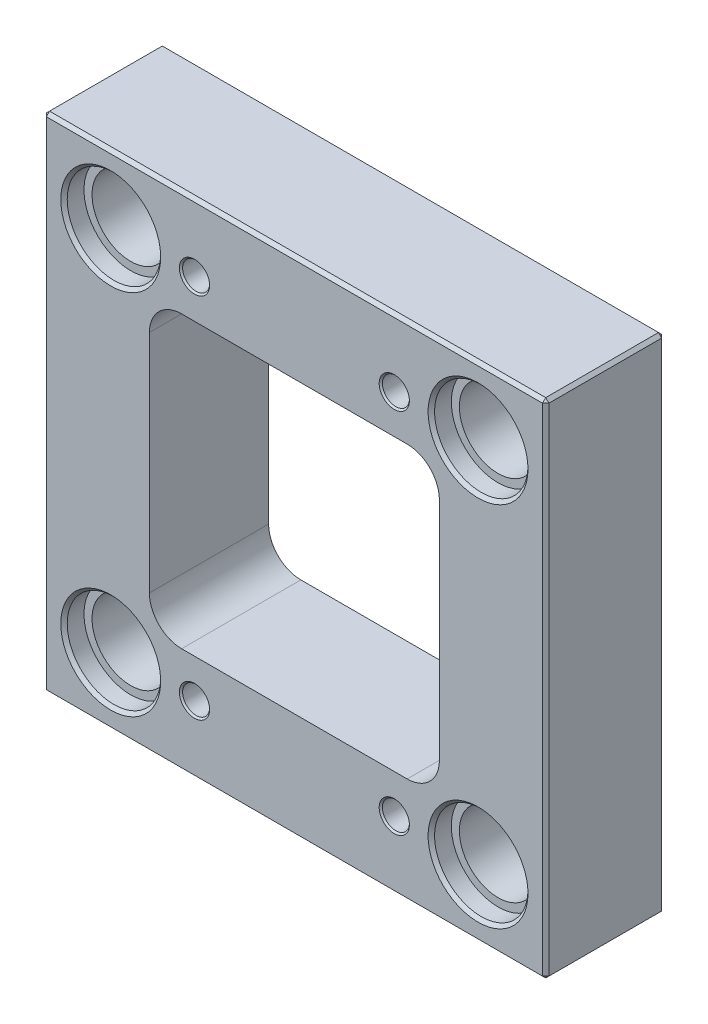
ISO-10303-21;
HEADER;
FILE_DESCRIPTION(('STEP AP214'),'2;1');
FILE_NAME('part.step','',(''),(''),'','','');
FILE_SCHEMA(('AUTOMOTIVE_DESIGN { 1 0 10303 214 1 1 1 1 }'));
ENDSEC;
DATA;
#1=APPLICATION_CONTEXT('core data for automotive mechanical design processes');
#2=APPLICATION_PROTOCOL_DEFINITION('international standard','automotive_design',2000,#1);
#3=PRODUCT_CONTEXT('',#1,'mechanical');
#4=PRODUCT('Part','Part','',(#3));
#5=PRODUCT_RELATED_PRODUCT_CATEGORY('part','',(#4));
#6=PRODUCT_DEFINITION_FORMATION('','',#4);
#7=PRODUCT_DEFINITION_CONTEXT('part definition',#1,'design');
#8=PRODUCT_DEFINITION('design','',#6,#7);
#9=PRODUCT_DEFINITION_SHAPE('','',#8);
#10=(LENGTH_UNIT() NAMED_UNIT(*) SI_UNIT(.MILLI.,.METRE.));
#11=(NAMED_UNIT(*) PLANE_ANGLE_UNIT() SI_UNIT($,.RADIAN.));
#12=(NAMED_UNIT(*) SI_UNIT($,.STERADIAN.) SOLID_ANGLE_UNIT());
#13=UNCERTAINTY_MEASURE_WITH_UNIT(LENGTH_MEASURE(1.E-05),#10,'distance_accuracy_value','');
#14=(GEOMETRIC_REPRESENTATION_CONTEXT(3) GLOBAL_UNCERTAINTY_ASSIGNED_CONTEXT((#13)) GLOBAL_UNIT_ASSIGNED_CONTEXT((#10,
#11,#12)) REPRESENTATION_CONTEXT('',''));
#15=CARTESIAN_POINT('',(0.,0.,0.));
#16=DIRECTION('',(0.,0.,1.));
#17=DIRECTION('',(1.,0.,0.));
#18=AXIS2_PLACEMENT_3D('',#15,#16,#17);
#19=CARTESIAN_POINT('',(109.,135.,17.0000000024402));
#20=DIRECTION('',(0.,0.,1.));
#21=DIRECTION('',(1.,0.,0.));
#22=AXIS2_PLACEMENT_3D('',#19,#20,#21);
#23=CONICAL_SURFACE('',#22,4.18799999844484,1.02974425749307);
#24=CARTESIAN_POINT('',(108.999999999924,135.,14.4835957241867));
#25=VERTEX_POINT('',#24);
#26=VERTEX_LOOP('',#25);
#27=FACE_BOUND('',#26,.T.);
#28=CARTESIAN_POINT('',(109.,135.,17.));
#29=DIRECTION('',(0.,0.,1.));
#30=DIRECTION('',(1.,0.,0.));
#31=AXIS2_PLACEMENT_3D('',#28,#29,#30);
#32=CIRCLE('',#31,4.188);
#33=CARTESIAN_POINT('',(113.188,135.,17.));
#34=VERTEX_POINT('',#33);
#35=EDGE_CURVE('E177',#34,#34,#32,.T.);
#36=ORIENTED_EDGE('',*,*,#35,.T.);
#37=EDGE_LOOP('',(#36));
#38=FACE_BOUND('',#37,.T.);
#39=ADVANCED_FACE('F17',(#27,#38),#23,.F.);
#40=CARTESIAN_POINT('',(109.,21.,17.0000000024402));
#41=DIRECTION('',(0.,0.,1.));
#42=DIRECTION('',(1.,0.,0.));
#43=AXIS2_PLACEMENT_3D('',#40,#41,#42);
#44=CONICAL_SURFACE('',#43,4.18799999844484,1.02974425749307);
#45=CARTESIAN_POINT('',(108.999999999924,21.,14.4835957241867));
#46=VERTEX_POINT('',#45);
#47=VERTEX_LOOP('',#46);
#48=FACE_BOUND('',#47,.T.);
#49=CARTESIAN_POINT('',(109.,21.,17.));
#50=DIRECTION('',(0.,0.,1.));
#51=DIRECTION('',(1.,0.,0.));
#52=AXIS2_PLACEMENT_3D('',#49,#50,#51);
#53=CIRCLE('',#52,4.188);
#54=CARTESIAN_POINT('',(113.188,21.,17.));
#55=VERTEX_POINT('',#54);
#56=EDGE_CURVE('E179',#55,#55,#53,.T.);
#57=ORIENTED_EDGE('',*,*,#56,.T.);
#58=EDGE_LOOP('',(#57));
#59=FACE_BOUND('',#58,.T.);
#60=ADVANCED_FACE('F174',(#48,#59),#44,.F.);
#61=CARTESIAN_POINT('',(47.,135.,17.0000000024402));
#62=DIRECTION('',(0.,0.,1.));
#63=DIRECTION('',(1.,0.,0.));
#64=AXIS2_PLACEMENT_3D('',#61,#62,#63);
#65=CONICAL_SURFACE('',#64,4.18799999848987,1.02974425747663);
#66=CARTESIAN_POINT('',(46.9999999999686,135.,14.4835957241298));
#67=VERTEX_POINT('',#66);
#68=VERTEX_LOOP('',#67);
#69=FACE_BOUND('',#68,.T.);
#70=CARTESIAN_POINT('',(47.,135.,17.));
#71=DIRECTION('',(0.,0.,1.));
#72=DIRECTION('',(1.,0.,0.));
#73=AXIS2_PLACEMENT_3D('',#70,#71,#72);
#74=CIRCLE('',#73,4.188);
#75=CARTESIAN_POINT('',(51.188,135.,17.));
#76=VERTEX_POINT('',#75);
#77=EDGE_CURVE('E182',#76,#76,#74,.T.);
#78=ORIENTED_EDGE('',*,*,#77,.T.);
#79=EDGE_LOOP('',(#78));
#80=FACE_BOUND('',#79,.T.);
#81=ADVANCED_FACE('F364',(#69,#80),#65,.F.);
#82=CARTESIAN_POINT('',(47.,21.,17.0000000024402));
#83=DIRECTION('',(0.,0.,1.));
#84=DIRECTION('',(1.,0.,0.));
#85=AXIS2_PLACEMENT_3D('',#82,#83,#84);
#86=CONICAL_SURFACE('',#85,4.18799999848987,1.02974425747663);
#87=CARTESIAN_POINT('',(46.9999999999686,21.,14.4835957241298));
#88=VERTEX_POINT('',#87);
#89=VERTEX_LOOP('',#88);
#90=FACE_BOUND('',#89,.T.);
#91=CARTESIAN_POINT('',(47.,21.,17.));
#92=DIRECTION('',(0.,0.,1.));
#93=DIRECTION('',(1.,0.,0.));
#94=AXIS2_PLACEMENT_3D('',#91,#92,#93);
#95=CIRCLE('',#94,4.188);
#96=CARTESIAN_POINT('',(51.188,21.,17.));
#97=VERTEX_POINT('',#96);
#98=EDGE_CURVE('E354',#97,#97,#95,.T.);
#99=ORIENTED_EDGE('',*,*,#98,.T.);
#100=EDGE_LOOP('',(#99));
#101=FACE_BOUND('',#100,.T.);
#102=ADVANCED_FACE('F867',(#90,#101),#86,.F.);
#103=CARTESIAN_POINT('',(0.500000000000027,155.5,36.));
#104=DIRECTION('',(-0.577350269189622,0.577350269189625,0.577350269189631));
#105=DIRECTION('',(0.,-0.707106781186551,0.707106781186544));
#106=AXIS2_PLACEMENT_3D('',#103,#104,#105);
#107=PLANE('',#106);
#108=DIRECTION('',(0.,-0.707106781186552,0.707106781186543));
#109=VECTOR('',#108,1.);
#110=CARTESIAN_POINT('',(1.00000000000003,155.5,36.5));
#111=LINE('',#110,#109);
#112=CARTESIAN_POINT('',(1.00000000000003,156.,36.));
#113=VERTEX_POINT('',#112);
#114=CARTESIAN_POINT('',(1.00000000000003,155.,37.));
#115=VERTEX_POINT('',#114);
#116=EDGE_CURVE('E336',#113,#115,#111,.T.);
#117=ORIENTED_EDGE('',*,*,#116,.F.);
#118=DIRECTION('',(-0.707106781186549,-0.707106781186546,0.));
#119=VECTOR('',#118,1.);
#120=CARTESIAN_POINT('',(0.500000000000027,155.5,36.));
#121=LINE('',#120,#119);
#122=CARTESIAN_POINT('',(0.,155.,36.));
#123=VERTEX_POINT('',#122);
#124=EDGE_CURVE('E340',#123,#113,#121,.F.);
#125=ORIENTED_EDGE('',*,*,#124,.F.);
#126=DIRECTION('',(0.707106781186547,0.,0.707106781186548));
#127=VECTOR('',#126,1.);
#128=CARTESIAN_POINT('',(0.500000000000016,155.,36.5));
#129=LINE('',#128,#127);
#130=EDGE_CURVE('E334',#115,#123,#129,.F.);
#131=ORIENTED_EDGE('',*,*,#130,.F.);
#132=EDGE_LOOP('',(#117,#125,#131));
#133=FACE_BOUND('',#132,.T.);
#134=ADVANCED_FACE('F859',(#133),#107,.T.);
#135=CARTESIAN_POINT('',(0.499999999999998,0.5,36.));
#136=DIRECTION('',(-0.577350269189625,-0.577350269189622,0.57735026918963));
#137=DIRECTION('',(0.707106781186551,0.,0.707106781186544));
#138=AXIS2_PLACEMENT_3D('',#135,#136,#137);
#139=PLANE('',#138);
#140=DIRECTION('',(0.707106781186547,0.,0.707106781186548));
#141=VECTOR('',#140,1.);
#142=CARTESIAN_POINT('',(0.500000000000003,1.,36.5));
#143=LINE('',#142,#141);
#144=CARTESIAN_POINT('',(0.,1.,36.));
#145=VERTEX_POINT('',#144);
#146=CARTESIAN_POINT('',(1.00000000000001,1.,37.));
#147=VERTEX_POINT('',#146);
#148=EDGE_CURVE('E332',#145,#147,#143,.T.);
#149=ORIENTED_EDGE('',*,*,#148,.F.);
#150=DIRECTION('',(0.707106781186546,-0.707106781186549,0.));
#151=VECTOR('',#150,1.);
#152=CARTESIAN_POINT('',(0.499999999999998,0.5,36.));
#153=LINE('',#152,#151);
#154=CARTESIAN_POINT('',(0.999999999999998,0.,36.));
#155=VERTEX_POINT('',#154);
#156=EDGE_CURVE('E352',#155,#145,#153,.F.);
#157=ORIENTED_EDGE('',*,*,#156,.F.);
#158=DIRECTION('',(0.,-0.707106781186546,-0.707106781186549));
#159=VECTOR('',#158,1.);
#160=CARTESIAN_POINT('',(1.,0.499999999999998,36.5));
#161=LINE('',#160,#159);
#162=EDGE_CURVE('E330',#147,#155,#161,.T.);
#163=ORIENTED_EDGE('',*,*,#162,.F.);
#164=EDGE_LOOP('',(#149,#157,#163));
#165=FACE_BOUND('',#164,.T.);
#166=ADVANCED_FACE('F851',(#165),#139,.T.);
#167=CARTESIAN_POINT('',(155.5,0.499999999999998,36.));
#168=DIRECTION('',(0.577350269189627,-0.577350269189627,0.577350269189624));
#169=DIRECTION('',(0.707106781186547,0.707106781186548,0.));
#170=AXIS2_PLACEMENT_3D('',#167,#168,#169);
#171=PLANE('',#170);
#172=DIRECTION('',(0.707106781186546,0.,-0.707106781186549));
#173=VECTOR('',#172,1.);
#174=CARTESIAN_POINT('',(155.5,1.,36.5));
#175=LINE('',#174,#173);
#176=CARTESIAN_POINT('',(155.,1.,37.));
#177=VERTEX_POINT('',#176);
#178=CARTESIAN_POINT('',(156.,0.999999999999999,36.));
#179=VERTEX_POINT('',#178);
#180=EDGE_CURVE('E326',#177,#179,#175,.T.);
#181=ORIENTED_EDGE('',*,*,#180,.F.);
#182=DIRECTION('',(0.,-0.707106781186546,-0.707106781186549));
#183=VECTOR('',#182,1.);
#184=CARTESIAN_POINT('',(155.,0.499999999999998,36.5));
#185=LINE('',#184,#183);
#186=CARTESIAN_POINT('',(155.,0.,36.));
#187=VERTEX_POINT('',#186);
#188=EDGE_CURVE('E328',#187,#177,#185,.F.);
#189=ORIENTED_EDGE('',*,*,#188,.F.);
#190=DIRECTION('',(0.707106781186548,0.707106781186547,0.));
#191=VECTOR('',#190,1.);
#192=CARTESIAN_POINT('',(155.5,0.499999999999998,36.));
#193=LINE('',#192,#191);
#194=EDGE_CURVE('E348',#179,#187,#193,.F.);
#195=ORIENTED_EDGE('',*,*,#194,.F.);
#196=EDGE_LOOP('',(#181,#189,#195));
#197=FACE_BOUND('',#196,.T.);
#198=ADVANCED_FACE('F843',(#197),#171,.T.);
#199=CARTESIAN_POINT('',(155.5,155.5,36.));
#200=DIRECTION('',(0.577350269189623,0.577350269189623,0.577350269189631));
#201=DIRECTION('',(0.,-0.707106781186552,0.707106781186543));
#202=AXIS2_PLACEMENT_3D('',#199,#200,#201);
#203=PLANE('',#202);
#204=DIRECTION('',(0.,-0.707106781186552,0.707106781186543));
#205=VECTOR('',#204,1.);
#206=CARTESIAN_POINT('',(155.,155.5,36.5));
#207=LINE('',#206,#205);
#208=CARTESIAN_POINT('',(155.,155.,37.));
#209=VERTEX_POINT('',#208);
#210=CARTESIAN_POINT('',(155.,156.,36.));
#211=VERTEX_POINT('',#210);
#212=EDGE_CURVE('E338',#209,#211,#207,.F.);
#213=ORIENTED_EDGE('',*,*,#212,.F.);
#214=DIRECTION('',(0.707106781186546,0.,-0.707106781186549));
#215=VECTOR('',#214,1.);
#216=CARTESIAN_POINT('',(155.5,155.,36.5));
#217=LINE('',#216,#215);
#218=CARTESIAN_POINT('',(156.,155.,36.));
#219=VERTEX_POINT('',#218);
#220=EDGE_CURVE('E322',#219,#209,#217,.F.);
#221=ORIENTED_EDGE('',*,*,#220,.F.);
#222=DIRECTION('',(-0.707106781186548,0.707106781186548,0.));
#223=VECTOR('',#222,1.);
#224=CARTESIAN_POINT('',(155.5,155.5,36.));
#225=LINE('',#224,#223);
#226=EDGE_CURVE('E344',#211,#219,#225,.F.);
#227=ORIENTED_EDGE('',*,*,#226,.F.);
#228=EDGE_LOOP('',(#213,#221,#227));
#229=FACE_BOUND('',#228,.T.);
#230=ADVANCED_FACE('F835',(#229),#203,.T.);
#231=CARTESIAN_POINT('',(109.,135.,27.));
#232=DIRECTION('',(0.,0.,1.));
#233=DIRECTION('',(1.,0.,0.));
#234=AXIS2_PLACEMENT_3D('',#231,#232,#233);
#235=CYLINDRICAL_SURFACE('',#234,4.188);
#236=CARTESIAN_POINT('',(109.,135.,36.4999999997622));
#237=DIRECTION('',(0.,0.,1.));
#238=DIRECTION('',(-1.,0.,0.));
#239=AXIS2_PLACEMENT_3D('',#236,#237,#238);
#240=CIRCLE('',#239,4.18800000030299);
#241=CARTESIAN_POINT('',(104.811999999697,135.,36.4999999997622));
#242=VERTEX_POINT('',#241);
#243=EDGE_CURVE('E317',#242,#242,#240,.T.);
#244=ORIENTED_EDGE('',*,*,#243,.T.);
#245=EDGE_LOOP('',(#244));
#246=FACE_BOUND('',#245,.T.);
#247=ORIENTED_EDGE('',*,*,#35,.F.);
#248=EDGE_LOOP('',(#247));
#249=FACE_BOUND('',#248,.T.);
#250=ADVANCED_FACE('F379',(#246,#249),#235,.F.);
#251=CARTESIAN_POINT('',(109.,21.,27.));
#252=DIRECTION('',(0.,0.,1.));
#253=DIRECTION('',(1.,0.,0.));
#254=AXIS2_PLACEMENT_3D('',#251,#252,#253);
#255=CYLINDRICAL_SURFACE('',#254,4.188);
#256=CARTESIAN_POINT('',(109.,21.,36.4999999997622));
#257=DIRECTION('',(0.,0.,1.));
#258=DIRECTION('',(-1.,0.,0.));
#259=AXIS2_PLACEMENT_3D('',#256,#257,#258);
#260=CIRCLE('',#259,4.18800000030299);
#261=CARTESIAN_POINT('',(104.811999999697,21.,36.4999999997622));
#262=VERTEX_POINT('',#261);
#263=EDGE_CURVE('E312',#262,#262,#260,.T.);
#264=ORIENTED_EDGE('',*,*,#263,.T.);
#265=EDGE_LOOP('',(#264));
#266=FACE_BOUND('',#265,.T.);
#267=ORIENTED_EDGE('',*,*,#56,.F.);
#268=EDGE_LOOP('',(#267));
#269=FACE_BOUND('',#268,.T.);
#270=ADVANCED_FACE('F369',(#266,#269),#255,.F.);
#271=CARTESIAN_POINT('',(47.,135.,27.));
#272=DIRECTION('',(0.,0.,1.));
#273=DIRECTION('',(1.,0.,0.));
#274=AXIS2_PLACEMENT_3D('',#271,#272,#273);
#275=CYLINDRICAL_SURFACE('',#274,4.188);
#276=CARTESIAN_POINT('',(47.,135.,36.4999999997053));
#277=DIRECTION('',(0.,0.,1.));
#278=DIRECTION('',(-1.,0.,0.));
#279=AXIS2_PLACEMENT_3D('',#276,#277,#278);
#280=CIRCLE('',#279,4.18800000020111);
#281=CARTESIAN_POINT('',(42.8119999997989,135.,36.4999999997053));
#282=VERTEX_POINT('',#281);
#283=EDGE_CURVE('E281',#282,#282,#280,.T.);
#284=ORIENTED_EDGE('',*,*,#283,.T.);
#285=EDGE_LOOP('',(#284));
#286=FACE_BOUND('',#285,.T.);
#287=ORIENTED_EDGE('',*,*,#77,.F.);
#288=EDGE_LOOP('',(#287));
#289=FACE_BOUND('',#288,.T.);
#290=ADVANCED_FACE('F366',(#286,#289),#275,.F.);
#291=CARTESIAN_POINT('',(47.,21.,27.));
#292=DIRECTION('',(0.,0.,1.));
#293=DIRECTION('',(1.,0.,0.));
#294=AXIS2_PLACEMENT_3D('',#291,#292,#293);
#295=CYLINDRICAL_SURFACE('',#294,4.188);
#296=CARTESIAN_POINT('',(47.,21.,36.4999999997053));
#297=DIRECTION('',(0.,0.,1.));
#298=DIRECTION('',(-1.,0.,0.));
#299=AXIS2_PLACEMENT_3D('',#296,#297,#298);
#300=CIRCLE('',#299,4.18800000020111);
#301=CARTESIAN_POINT('',(42.8119999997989,21.,36.4999999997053));
#302=VERTEX_POINT('',#301);
#303=EDGE_CURVE('E277',#302,#302,#300,.T.);
#304=ORIENTED_EDGE('',*,*,#303,.T.);
#305=EDGE_LOOP('',(#304));
#306=FACE_BOUND('',#305,.T.);
#307=ORIENTED_EDGE('',*,*,#98,.F.);
#308=EDGE_LOOP('',(#307));
#309=FACE_BOUND('',#308,.T.);
#310=ADVANCED_FACE('F368',(#306,#309),#295,.F.);
#311=CARTESIAN_POINT('',(135.,135.,33.9));
#312=DIRECTION('',(0.,0.,1.));
#313=DIRECTION('',(1.,0.,0.));
#314=AXIS2_PLACEMENT_3D('',#311,#312,#313);
#315=CYLINDRICAL_SURFACE('',#314,14.5);
#316=CARTESIAN_POINT('',(135.,135.,35.9999999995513));
#317=DIRECTION('',(0.,0.,1.));
#318=DIRECTION('',(-1.,0.,0.));
#319=AXIS2_PLACEMENT_3D('',#316,#317,#318);
#320=CIRCLE('',#319,14.5000000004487);
#321=CARTESIAN_POINT('',(120.499999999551,135.,35.9999999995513));
#322=VERTEX_POINT('',#321);
#323=EDGE_CURVE('E307',#322,#322,#320,.T.);
#324=ORIENTED_EDGE('',*,*,#323,.T.);
#325=EDGE_LOOP('',(#324));
#326=FACE_BOUND('',#325,.T.);
#327=CARTESIAN_POINT('',(135.,135.,30.8));
#328=DIRECTION('',(0.,0.,1.));
#329=DIRECTION('',(1.,0.,0.));
#330=AXIS2_PLACEMENT_3D('',#327,#328,#329);
#331=CIRCLE('',#330,14.5);
#332=CARTESIAN_POINT('',(149.5,135.,30.8));
#333=VERTEX_POINT('',#332);
#334=EDGE_CURVE('E20',#333,#333,#331,.T.);
#335=ORIENTED_EDGE('',*,*,#334,.F.);
#336=EDGE_LOOP('',(#335));
#337=FACE_BOUND('',#336,.T.);
#338=ADVANCED_FACE('F377',(#326,#337),#315,.F.);
#339=CARTESIAN_POINT('',(21.,21.,33.9));
#340=DIRECTION('',(0.,0.,1.));
#341=DIRECTION('',(1.,0.,0.));
#342=AXIS2_PLACEMENT_3D('',#339,#340,#341);
#343=CYLINDRICAL_SURFACE('',#342,14.5);
#344=CARTESIAN_POINT('',(21.,21.,35.9999999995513));
#345=DIRECTION('',(0.,0.,1.));
#346=DIRECTION('',(-1.,0.,0.));
#347=AXIS2_PLACEMENT_3D('',#344,#345,#346);
#348=CIRCLE('',#347,14.5000000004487);
#349=CARTESIAN_POINT('',(6.49999999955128,21.,35.9999999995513));
#350=VERTEX_POINT('',#349);
#351=EDGE_CURVE('E302',#350,#350,#348,.T.);
#352=ORIENTED_EDGE('',*,*,#351,.T.);
#353=EDGE_LOOP('',(#352));
#354=FACE_BOUND('',#353,.T.);
#355=CARTESIAN_POINT('',(21.,21.,30.8));
#356=DIRECTION('',(0.,0.,1.));
#357=DIRECTION('',(1.,0.,0.));
#358=AXIS2_PLACEMENT_3D('',#355,#356,#357);
#359=CIRCLE('',#358,14.5);
#360=CARTESIAN_POINT('',(35.5,21.,30.8));
#361=VERTEX_POINT('',#360);
#362=EDGE_CURVE('E272',#361,#361,#359,.T.);
#363=ORIENTED_EDGE('',*,*,#362,.F.);
#364=EDGE_LOOP('',(#363));
#365=FACE_BOUND('',#364,.T.);
#366=ADVANCED_FACE('F591',(#354,#365),#343,.F.);
#367=CARTESIAN_POINT('',(135.,21.,33.9));
#368=DIRECTION('',(0.,0.,1.));
#369=DIRECTION('',(1.,0.,0.));
#370=AXIS2_PLACEMENT_3D('',#367,#368,#369);
#371=CYLINDRICAL_SURFACE('',#370,14.5);
#372=CARTESIAN_POINT('',(135.,21.,35.9999999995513));
#373=DIRECTION('',(0.,0.,1.));
#374=DIRECTION('',(-1.,0.,0.));
#375=AXIS2_PLACEMENT_3D('',#372,#373,#374);
#376=CIRCLE('',#375,14.5000000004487);
#377=CARTESIAN_POINT('',(120.499999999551,21.,35.9999999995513));
#378=VERTEX_POINT('',#377);
#379=EDGE_CURVE('E297',#378,#378,#376,.T.);
#380=ORIENTED_EDGE('',*,*,#379,.T.);
#381=EDGE_LOOP('',(#380));
#382=FACE_BOUND('',#381,.T.);
#383=CARTESIAN_POINT('',(135.,21.,30.8));
#384=DIRECTION('',(0.,0.,1.));
#385=DIRECTION('',(1.,0.,0.));
#386=AXIS2_PLACEMENT_3D('',#383,#384,#385);
#387=CIRCLE('',#386,14.5);
#388=CARTESIAN_POINT('',(149.5,21.,30.8));
#389=VERTEX_POINT('',#388);
#390=EDGE_CURVE('E270',#389,#389,#387,.T.);
#391=ORIENTED_EDGE('',*,*,#390,.F.);
#392=EDGE_LOOP('',(#391));
#393=FACE_BOUND('',#392,.T.);
#394=ADVANCED_FACE('F587',(#382,#393),#371,.F.);
#395=CARTESIAN_POINT('',(21.,135.,33.9));
#396=DIRECTION('',(0.,0.,1.));
#397=DIRECTION('',(1.,0.,0.));
#398=AXIS2_PLACEMENT_3D('',#395,#396,#397);
#399=CYLINDRICAL_SURFACE('',#398,14.5);
#400=CARTESIAN_POINT('',(21.,135.,35.9999999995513));
#401=DIRECTION('',(0.,0.,1.));
#402=DIRECTION('',(-1.,0.,0.));
#403=AXIS2_PLACEMENT_3D('',#400,#401,#402);
#404=CIRCLE('',#403,14.5000000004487);
#405=CARTESIAN_POINT('',(6.49999999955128,135.,35.9999999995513));
#406=VERTEX_POINT('',#405);
#407=EDGE_CURVE('E286',#406,#406,#404,.T.);
#408=ORIENTED_EDGE('',*,*,#407,.T.);
#409=EDGE_LOOP('',(#408));
#410=FACE_BOUND('',#409,.T.);
#411=CARTESIAN_POINT('',(21.,135.,30.8));
#412=DIRECTION('',(0.,0.,1.));
#413=DIRECTION('',(1.,0.,0.));
#414=AXIS2_PLACEMENT_3D('',#411,#412,#413);
#415=CIRCLE('',#414,14.5);
#416=CARTESIAN_POINT('',(35.5,135.,30.8));
#417=VERTEX_POINT('',#416);
#418=EDGE_CURVE('E266',#417,#417,#415,.T.);
#419=ORIENTED_EDGE('',*,*,#418,.F.);
#420=EDGE_LOOP('',(#419));
#421=FACE_BOUND('',#420,.T.);
#422=ADVANCED_FACE('F583',(#410,#421),#399,.F.);
#423=CARTESIAN_POINT('',(0.499999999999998,0.5,0.));
#424=DIRECTION('',(-0.707106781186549,-0.707106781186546,0.));
#425=DIRECTION('',(0.707106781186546,-0.707106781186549,0.));
#426=AXIS2_PLACEMENT_3D('',#423,#424,#425);
#427=PLANE('',#426);
#428=DIRECTION('',(0.707106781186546,-0.707106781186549,0.));
#429=VECTOR('',#428,1.);
#430=CARTESIAN_POINT('',(0.499999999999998,0.5,1.));
#431=LINE('',#430,#429);
#432=CARTESIAN_POINT('',(0.,1.,1.));
#433=VERTEX_POINT('',#432);
#434=CARTESIAN_POINT('',(0.999999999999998,0.,1.));
#435=VERTEX_POINT('',#434);
#436=EDGE_CURVE('E350',#433,#435,#431,.T.);
#437=ORIENTED_EDGE('',*,*,#436,.T.);
#438=DIRECTION('',(0.,0.,-1.));
#439=VECTOR('',#438,1.);
#440=CARTESIAN_POINT('',(1.,0.,0.));
#441=LINE('',#440,#439);
#442=EDGE_CURVE('E943',#155,#435,#441,.T.);
#443=ORIENTED_EDGE('',*,*,#442,.F.);
#444=ORIENTED_EDGE('',*,*,#156,.T.);
#445=DIRECTION('',(0.,0.,1.));
#446=VECTOR('',#445,1.);
#447=CARTESIAN_POINT('',(0.,1.,0.));
#448=LINE('',#447,#446);
#449=EDGE_CURVE('E947',#433,#145,#448,.T.);
#450=ORIENTED_EDGE('',*,*,#449,.F.);
#451=EDGE_LOOP('',(#437,#443,#444,#450));
#452=FACE_BOUND('',#451,.T.);
#453=ADVANCED_FACE('F579',(#452),#427,.T.);
#454=CARTESIAN_POINT('',(155.5,0.499999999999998,0.));
#455=DIRECTION('',(0.707106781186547,-0.707106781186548,0.));
#456=DIRECTION('',(0.707106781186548,0.707106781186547,0.));
#457=AXIS2_PLACEMENT_3D('',#454,#455,#456);
#458=PLANE('',#457);
#459=DIRECTION('',(0.707106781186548,0.707106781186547,0.));
#460=VECTOR('',#459,1.);
#461=CARTESIAN_POINT('',(155.5,0.499999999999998,1.));
#462=LINE('',#461,#460);
#463=CARTESIAN_POINT('',(155.,0.,0.999999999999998));
#464=VERTEX_POINT('',#463);
#465=CARTESIAN_POINT('',(156.,0.999999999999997,1.00000000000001));
#466=VERTEX_POINT('',#465);
#467=EDGE_CURVE('E346',#464,#466,#462,.T.);
#468=ORIENTED_EDGE('',*,*,#467,.T.);
#469=DIRECTION('',(0.,0.,-1.));
#470=VECTOR('',#469,1.);
#471=CARTESIAN_POINT('',(156.,1.,0.));
#472=LINE('',#471,#470);
#473=EDGE_CURVE('E926',#179,#466,#472,.T.);
#474=ORIENTED_EDGE('',*,*,#473,.F.);
#475=ORIENTED_EDGE('',*,*,#194,.T.);
#476=DIRECTION('',(0.,0.,-1.));
#477=VECTOR('',#476,1.);
#478=CARTESIAN_POINT('',(155.,0.,0.));
#479=LINE('',#478,#477);
#480=EDGE_CURVE('E940',#464,#187,#479,.F.);
#481=ORIENTED_EDGE('',*,*,#480,.F.);
#482=EDGE_LOOP('',(#468,#474,#475,#481));
#483=FACE_BOUND('',#482,.T.);
#484=ADVANCED_FACE('F575',(#483),#458,.T.);
#485=CARTESIAN_POINT('',(155.5,155.5,0.));
#486=DIRECTION('',(0.707106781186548,0.707106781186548,0.));
#487=DIRECTION('',(-0.707106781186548,0.707106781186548,0.));
#488=AXIS2_PLACEMENT_3D('',#485,#486,#487);
#489=PLANE('',#488);
#490=DIRECTION('',(-0.707106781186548,0.707106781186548,0.));
#491=VECTOR('',#490,1.);
#492=CARTESIAN_POINT('',(155.5,155.5,1.));
#493=LINE('',#492,#491);
#494=CARTESIAN_POINT('',(156.,155.,0.999999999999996));
#495=VERTEX_POINT('',#494);
#496=CARTESIAN_POINT('',(155.,156.,0.999999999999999));
#497=VERTEX_POINT('',#496);
#498=EDGE_CURVE('E342',#495,#497,#493,.T.);
#499=ORIENTED_EDGE('',*,*,#498,.T.);
#500=DIRECTION('',(0.,0.,1.));
#501=VECTOR('',#500,1.);
#502=CARTESIAN_POINT('',(155.,156.,0.));
#503=LINE('',#502,#501);
#504=EDGE_CURVE('E920',#211,#497,#503,.F.);
#505=ORIENTED_EDGE('',*,*,#504,.F.);
#506=ORIENTED_EDGE('',*,*,#226,.T.);
#507=DIRECTION('',(0.,0.,-1.));
#508=VECTOR('',#507,1.);
#509=CARTESIAN_POINT('',(156.,155.,0.));
#510=LINE('',#509,#508);
#511=EDGE_CURVE('E934',#495,#219,#510,.F.);
#512=ORIENTED_EDGE('',*,*,#511,.F.);
#513=EDGE_LOOP('',(#499,#505,#506,#512));
#514=FACE_BOUND('',#513,.T.);
#515=ADVANCED_FACE('F571',(#514),#489,.T.);
#516=CARTESIAN_POINT('',(0.500000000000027,155.5,0.));
#517=DIRECTION('',(-0.707106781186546,0.707106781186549,0.));
#518=DIRECTION('',(-0.707106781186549,-0.707106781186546,0.));
#519=AXIS2_PLACEMENT_3D('',#516,#517,#518);
#520=PLANE('',#519);
#521=DIRECTION('',(-0.707106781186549,-0.707106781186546,0.));
#522=VECTOR('',#521,1.);
#523=CARTESIAN_POINT('',(0.750000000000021,155.75,1.00000000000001));
#524=LINE('',#523,#522);
#525=CARTESIAN_POINT('',(0.,155.,1.));
#526=VERTEX_POINT('',#525);
#527=CARTESIAN_POINT('',(1.00000000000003,156.,1.));
#528=VERTEX_POINT('',#527);
#529=EDGE_CURVE('E923',#526,#528,#524,.F.);
#530=ORIENTED_EDGE('',*,*,#529,.F.);
#531=DIRECTION('',(0.,0.,1.));
#532=VECTOR('',#531,1.);
#533=CARTESIAN_POINT('',(0.,155.,0.));
#534=LINE('',#533,#532);
#535=EDGE_CURVE('E269',#123,#526,#534,.F.);
#536=ORIENTED_EDGE('',*,*,#535,.F.);
#537=ORIENTED_EDGE('',*,*,#124,.T.);
#538=DIRECTION('',(0.,0.,1.));
#539=VECTOR('',#538,1.);
#540=CARTESIAN_POINT('',(1.00000000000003,156.,0.));
#541=LINE('',#540,#539);
#542=EDGE_CURVE('E912',#528,#113,#541,.T.);
#543=ORIENTED_EDGE('',*,*,#542,.F.);
#544=EDGE_LOOP('',(#530,#536,#537,#543));
#545=FACE_BOUND('',#544,.T.);
#546=ADVANCED_FACE('F567',(#545),#520,.T.);
#547=CARTESIAN_POINT('',(39.,155.5,36.5));
#548=DIRECTION('',(0.,0.707106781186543,0.707106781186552));
#549=DIRECTION('',(0.,-0.707106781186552,0.707106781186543));
#550=AXIS2_PLACEMENT_3D('',#547,#548,#549);
#551=PLANE('',#550);
#552=ORIENTED_EDGE('',*,*,#116,.T.);
#553=DIRECTION('',(1.,0.,0.));
#554=VECTOR('',#553,1.);
#555=CARTESIAN_POINT('',(78.,155.,37.));
#556=LINE('',#555,#554);
#557=EDGE_CURVE('E919',#209,#115,#556,.F.);
#558=ORIENTED_EDGE('',*,*,#557,.F.);
#559=ORIENTED_EDGE('',*,*,#212,.T.);
#560=DIRECTION('',(1.,0.,0.));
#561=VECTOR('',#560,1.);
#562=CARTESIAN_POINT('',(0.,156.,36.));
#563=LINE('',#562,#561);
#564=EDGE_CURVE('E914',#113,#211,#563,.T.);
#565=ORIENTED_EDGE('',*,*,#564,.F.);
#566=EDGE_LOOP('',(#552,#558,#559,#565));
#567=FACE_BOUND('',#566,.T.);
#568=ADVANCED_FACE('F563',(#567),#551,.T.);
#569=CARTESIAN_POINT('',(0.500000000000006,39.,36.5));
#570=DIRECTION('',(-0.707106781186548,0.,0.707106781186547));
#571=DIRECTION('',(0.707106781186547,0.,0.707106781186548));
#572=AXIS2_PLACEMENT_3D('',#569,#570,#571);
#573=PLANE('',#572);
#574=ORIENTED_EDGE('',*,*,#148,.T.);
#575=DIRECTION('',(0.,1.,0.));
#576=VECTOR('',#575,1.);
#577=CARTESIAN_POINT('',(1.00000000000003,78.,37.));
#578=LINE('',#577,#576);
#579=EDGE_CURVE('E979',#115,#147,#578,.F.);
#580=ORIENTED_EDGE('',*,*,#579,.F.);
#581=ORIENTED_EDGE('',*,*,#130,.T.);
#582=DIRECTION('',(0.,1.,0.));
#583=VECTOR('',#582,1.);
#584=CARTESIAN_POINT('',(0.,0.,36.));
#585=LINE('',#584,#583);
#586=EDGE_CURVE('E946',#145,#123,#585,.T.);
#587=ORIENTED_EDGE('',*,*,#586,.F.);
#588=EDGE_LOOP('',(#574,#580,#581,#587));
#589=FACE_BOUND('',#588,.T.);
#590=ADVANCED_FACE('F559',(#589),#573,.T.);
#591=CARTESIAN_POINT('',(117.,0.499999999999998,36.5));
#592=DIRECTION('',(0.,-0.707106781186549,0.707106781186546));
#593=DIRECTION('',(0.,-0.707106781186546,-0.707106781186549));
#594=AXIS2_PLACEMENT_3D('',#591,#592,#593);
#595=PLANE('',#594);
#596=ORIENTED_EDGE('',*,*,#188,.T.);
#597=DIRECTION('',(1.,0.,0.));
#598=VECTOR('',#597,1.);
#599=CARTESIAN_POINT('',(78.,1.,37.));
#600=LINE('',#599,#598);
#601=EDGE_CURVE('E976',#147,#177,#600,.T.);
#602=ORIENTED_EDGE('',*,*,#601,.F.);
#603=ORIENTED_EDGE('',*,*,#162,.T.);
#604=DIRECTION('',(1.,0.,0.));
#605=VECTOR('',#604,1.);
#606=CARTESIAN_POINT('',(156.,0.,36.));
#607=LINE('',#606,#605);
#608=EDGE_CURVE('E937',#187,#155,#607,.F.);
#609=ORIENTED_EDGE('',*,*,#608,.F.);
#610=EDGE_LOOP('',(#596,#602,#603,#609));
#611=FACE_BOUND('',#610,.T.);
#612=ADVANCED_FACE('F555',(#611),#595,.T.);
#613=CARTESIAN_POINT('',(155.5,117.,36.5));
#614=DIRECTION('',(0.707106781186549,0.,0.707106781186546));
#615=DIRECTION('',(0.707106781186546,0.,-0.707106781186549));
#616=AXIS2_PLACEMENT_3D('',#613,#614,#615);
#617=PLANE('',#616);
#618=ORIENTED_EDGE('',*,*,#220,.T.);
#619=DIRECTION('',(0.,1.,0.));
#620=VECTOR('',#619,1.);
#621=CARTESIAN_POINT('',(155.,78.,37.));
#622=LINE('',#621,#620);
#623=EDGE_CURVE('E265',#177,#209,#622,.T.);
#624=ORIENTED_EDGE('',*,*,#623,.F.);
#625=ORIENTED_EDGE('',*,*,#180,.T.);
#626=DIRECTION('',(0.,1.,0.));
#627=VECTOR('',#626,1.);
#628=CARTESIAN_POINT('',(156.,156.,36.));
#629=LINE('',#628,#627);
#630=EDGE_CURVE('E931',#219,#179,#629,.F.);
#631=ORIENTED_EDGE('',*,*,#630,.F.);
#632=EDGE_LOOP('',(#618,#624,#625,#631));
#633=FACE_BOUND('',#632,.T.);
#634=ADVANCED_FACE('F551',(#633),#617,.T.);
#635=CARTESIAN_POINT('',(109.,135.,37.0000000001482));
#636=DIRECTION('',(0.,0.,1.));
#637=DIRECTION('',(1.,0.,0.));
#638=AXIS2_PLACEMENT_3D('',#635,#636,#637);
#639=CONICAL_SURFACE('',#638,4.68799999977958,0.785398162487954);
#640=CARTESIAN_POINT('',(109.,135.,37.0000000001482));
#641=DIRECTION('',(0.,0.,1.));
#642=DIRECTION('',(1.,0.,0.));
#643=AXIS2_PLACEMENT_3D('',#640,#641,#642);
#644=CIRCLE('',#643,4.68799999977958);
#645=CARTESIAN_POINT('',(113.68799999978,135.,37.0000000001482));
#646=VERTEX_POINT('',#645);
#647=EDGE_CURVE('E262',#646,#646,#644,.F.);
#648=ORIENTED_EDGE('',*,*,#647,.F.);
#649=EDGE_LOOP('',(#648));
#650=FACE_BOUND('',#649,.T.);
#651=ORIENTED_EDGE('',*,*,#243,.F.);
#652=EDGE_LOOP('',(#651));
#653=FACE_BOUND('',#652,.T.);
#654=ADVANCED_FACE('F547',(#650,#653),#639,.F.);
#655=CARTESIAN_POINT('',(109.,21.,37.0000000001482));
#656=DIRECTION('',(0.,0.,1.));
#657=DIRECTION('',(1.,0.,0.));
#658=AXIS2_PLACEMENT_3D('',#655,#656,#657);
#659=CONICAL_SURFACE('',#658,4.68799999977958,0.785398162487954);
#660=CARTESIAN_POINT('',(109.,21.,37.0000000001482));
#661=DIRECTION('',(0.,0.,1.));
#662=DIRECTION('',(1.,0.,0.));
#663=AXIS2_PLACEMENT_3D('',#660,#661,#662);
#664=CIRCLE('',#663,4.68799999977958);
#665=CARTESIAN_POINT('',(113.68799999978,21.,37.0000000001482));
#666=VERTEX_POINT('',#665);
#667=EDGE_CURVE('E259',#666,#666,#664,.F.);
#668=ORIENTED_EDGE('',*,*,#667,.F.);
#669=EDGE_LOOP('',(#668));
#670=FACE_BOUND('',#669,.T.);
#671=ORIENTED_EDGE('',*,*,#263,.F.);
#672=EDGE_LOOP('',(#671));
#673=FACE_BOUND('',#672,.T.);
#674=ADVANCED_FACE('F543',(#670,#673),#659,.F.);
#675=CARTESIAN_POINT('',(135.,135.,37.0000000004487));
#676=DIRECTION('',(0.,0.,1.));
#677=DIRECTION('',(1.,0.,0.));
#678=AXIS2_PLACEMENT_3D('',#675,#676,#677);
#679=CONICAL_SURFACE('',#678,15.4999999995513,0.785398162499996);
#680=CARTESIAN_POINT('',(135.,135.,37.0000000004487));
#681=DIRECTION('',(0.,0.,1.));
#682=DIRECTION('',(1.,0.,0.));
#683=AXIS2_PLACEMENT_3D('',#680,#681,#682);
#684=CIRCLE('',#683,15.4999999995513);
#685=CARTESIAN_POINT('',(150.499999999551,135.,37.0000000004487));
#686=VERTEX_POINT('',#685);
#687=EDGE_CURVE('E256',#686,#686,#684,.F.);
#688=ORIENTED_EDGE('',*,*,#687,.F.);
#689=EDGE_LOOP('',(#688));
#690=FACE_BOUND('',#689,.T.);
#691=ORIENTED_EDGE('',*,*,#323,.F.);
#692=EDGE_LOOP('',(#691));
#693=FACE_BOUND('',#692,.T.);
#694=ADVANCED_FACE('F539',(#690,#693),#679,.F.);
#695=CARTESIAN_POINT('',(21.,21.,37.0000000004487));
#696=DIRECTION('',(0.,0.,1.));
#697=DIRECTION('',(0.,-1.,0.));
#698=AXIS2_PLACEMENT_3D('',#695,#696,#697);
#699=CONICAL_SURFACE('',#698,15.4999999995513,0.7853981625);
#700=CARTESIAN_POINT('',(21.,21.,37.0000000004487));
#701=DIRECTION('',(0.,0.,1.));
#702=DIRECTION('',(0.,-1.,0.));
#703=AXIS2_PLACEMENT_3D('',#700,#701,#702);
#704=CIRCLE('',#703,15.4999999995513);
#705=CARTESIAN_POINT('',(21.,5.50000000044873,37.0000000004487));
#706=VERTEX_POINT('',#705);
#707=EDGE_CURVE('E253',#706,#706,#704,.F.);
#708=ORIENTED_EDGE('',*,*,#707,.F.);
#709=EDGE_LOOP('',(#708));
#710=FACE_BOUND('',#709,.T.);
#711=ORIENTED_EDGE('',*,*,#351,.F.);
#712=EDGE_LOOP('',(#711));
#713=FACE_BOUND('',#712,.T.);
#714=ADVANCED_FACE('F535',(#710,#713),#699,.F.);
#715=CARTESIAN_POINT('',(135.,21.,37.0000000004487));
#716=DIRECTION('',(0.,0.,1.));
#717=DIRECTION('',(1.,0.,0.));
#718=AXIS2_PLACEMENT_3D('',#715,#716,#717);
#719=CONICAL_SURFACE('',#718,15.4999999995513,0.785398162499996);
#720=CARTESIAN_POINT('',(135.,21.,37.0000000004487));
#721=DIRECTION('',(0.,0.,1.));
#722=DIRECTION('',(1.,0.,0.));
#723=AXIS2_PLACEMENT_3D('',#720,#721,#722);
#724=CIRCLE('',#723,15.4999999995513);
#725=CARTESIAN_POINT('',(150.499999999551,21.,37.0000000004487));
#726=VERTEX_POINT('',#725);
#727=EDGE_CURVE('E250',#726,#726,#724,.F.);
#728=ORIENTED_EDGE('',*,*,#727,.F.);
#729=EDGE_LOOP('',(#728));
#730=FACE_BOUND('',#729,.T.);
#731=ORIENTED_EDGE('',*,*,#379,.F.);
#732=EDGE_LOOP('',(#731));
#733=FACE_BOUND('',#732,.T.);
#734=ADVANCED_FACE('F531',(#730,#733),#719,.F.);
#735=CARTESIAN_POINT('',(21.,135.,37.0000000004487));
#736=DIRECTION('',(0.,0.,1.));
#737=DIRECTION('',(0.,-1.,0.));
#738=AXIS2_PLACEMENT_3D('',#735,#736,#737);
#739=CONICAL_SURFACE('',#738,15.4999999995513,0.7853981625);
#740=CARTESIAN_POINT('',(21.,135.,37.0000000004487));
#741=DIRECTION('',(0.,0.,1.));
#742=DIRECTION('',(0.,-1.,0.));
#743=AXIS2_PLACEMENT_3D('',#740,#741,#742);
#744=CIRCLE('',#743,15.4999999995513);
#745=CARTESIAN_POINT('',(21.,119.500000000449,37.0000000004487));
#746=VERTEX_POINT('',#745);
#747=EDGE_CURVE('E247',#746,#746,#744,.F.);
#748=ORIENTED_EDGE('',*,*,#747,.F.);
#749=EDGE_LOOP('',(#748));
#750=FACE_BOUND('',#749,.T.);
#751=ORIENTED_EDGE('',*,*,#407,.F.);
#752=EDGE_LOOP('',(#751));
#753=FACE_BOUND('',#752,.T.);
#754=ADVANCED_FACE('F527',(#750,#753),#739,.F.);
#755=CARTESIAN_POINT('',(47.,135.,37.0000000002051));
#756=DIRECTION('',(0.,0.,1.));
#757=DIRECTION('',(1.,0.,0.));
#758=AXIS2_PLACEMENT_3D('',#755,#756,#757);
#759=CONICAL_SURFACE('',#758,4.68799999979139,0.785398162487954);
#760=CARTESIAN_POINT('',(47.,135.,37.0000000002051));
#761=DIRECTION('',(0.,0.,1.));
#762=DIRECTION('',(1.,0.,0.));
#763=AXIS2_PLACEMENT_3D('',#760,#761,#762);
#764=CIRCLE('',#763,4.68799999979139);
#765=CARTESIAN_POINT('',(51.6879999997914,135.,37.0000000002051));
#766=VERTEX_POINT('',#765);
#767=EDGE_CURVE('E244',#766,#766,#764,.F.);
#768=ORIENTED_EDGE('',*,*,#767,.F.);
#769=EDGE_LOOP('',(#768));
#770=FACE_BOUND('',#769,.T.);
#771=ORIENTED_EDGE('',*,*,#283,.F.);
#772=EDGE_LOOP('',(#771));
#773=FACE_BOUND('',#772,.T.);
#774=ADVANCED_FACE('F523',(#770,#773),#759,.F.);
#775=CARTESIAN_POINT('',(47.,21.,37.0000000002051));
#776=DIRECTION('',(0.,0.,1.));
#777=DIRECTION('',(1.,0.,0.));
#778=AXIS2_PLACEMENT_3D('',#775,#776,#777);
#779=CONICAL_SURFACE('',#778,4.68799999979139,0.785398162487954);
#780=CARTESIAN_POINT('',(47.,21.,37.0000000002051));
#781=DIRECTION('',(0.,0.,1.));
#782=DIRECTION('',(1.,0.,0.));
#783=AXIS2_PLACEMENT_3D('',#780,#781,#782);
#784=CIRCLE('',#783,4.68799999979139);
#785=CARTESIAN_POINT('',(51.6879999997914,21.,37.0000000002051));
#786=VERTEX_POINT('',#785);
#787=EDGE_CURVE('E241',#786,#786,#784,.F.);
#788=ORIENTED_EDGE('',*,*,#787,.F.);
#789=EDGE_LOOP('',(#788));
#790=FACE_BOUND('',#789,.T.);
#791=ORIENTED_EDGE('',*,*,#303,.F.);
#792=EDGE_LOOP('',(#791));
#793=FACE_BOUND('',#792,.T.);
#794=ADVANCED_FACE('F519',(#790,#793),#779,.F.);
#795=CARTESIAN_POINT('',(135.,135.,30.8));
#796=DIRECTION('',(0.,0.,1.));
#797=DIRECTION('',(1.,0.,0.));
#798=AXIS2_PLACEMENT_3D('',#795,#796,#797);
#799=PLANE('',#798);
#800=CARTESIAN_POINT('',(135.,135.,30.8));
#801=DIRECTION('',(0.,0.,1.));
#802=DIRECTION('',(1.,0.,0.));
#803=AXIS2_PLACEMENT_3D('',#800,#801,#802);
#804=CIRCLE('',#803,12.00525);
#805=CARTESIAN_POINT('',(147.00525,135.,30.8));
#806=VERTEX_POINT('',#805);
#807=EDGE_CURVE('E238',#806,#806,#804,.F.);
#808=ORIENTED_EDGE('',*,*,#807,.T.);
#809=EDGE_LOOP('',(#808));
#810=FACE_BOUND('',#809,.T.);
#811=ORIENTED_EDGE('',*,*,#334,.T.);
#812=EDGE_LOOP('',(#811));
#813=FACE_BOUND('',#812,.T.);
#814=ADVANCED_FACE('F515',(#810,#813),#799,.T.);
#815=CARTESIAN_POINT('',(21.,21.,30.8));
#816=DIRECTION('',(0.,0.,1.));
#817=DIRECTION('',(1.,0.,0.));
#818=AXIS2_PLACEMENT_3D('',#815,#816,#817);
#819=PLANE('',#818);
#820=CARTESIAN_POINT('',(21.,21.,30.8));
#821=DIRECTION('',(0.,0.,1.));
#822=DIRECTION('',(1.,0.,0.));
#823=AXIS2_PLACEMENT_3D('',#820,#821,#822);
#824=CIRCLE('',#823,12.00525);
#825=CARTESIAN_POINT('',(33.00525,21.,30.8));
#826=VERTEX_POINT('',#825);
#827=EDGE_CURVE('E235',#826,#826,#824,.F.);
#828=ORIENTED_EDGE('',*,*,#827,.T.);
#829=EDGE_LOOP('',(#828));
#830=FACE_BOUND('',#829,.T.);
#831=ORIENTED_EDGE('',*,*,#362,.T.);
#832=EDGE_LOOP('',(#831));
#833=FACE_BOUND('',#832,.T.);
#834=ADVANCED_FACE('F511',(#830,#833),#819,.T.);
#835=CARTESIAN_POINT('',(135.,21.,30.8));
#836=DIRECTION('',(0.,0.,1.));
#837=DIRECTION('',(1.,0.,0.));
#838=AXIS2_PLACEMENT_3D('',#835,#836,#837);
#839=PLANE('',#838);
#840=CARTESIAN_POINT('',(135.,21.,30.8));
#841=DIRECTION('',(0.,0.,1.));
#842=DIRECTION('',(1.,0.,0.));
#843=AXIS2_PLACEMENT_3D('',#840,#841,#842);
#844=CIRCLE('',#843,12.00525);
#845=CARTESIAN_POINT('',(147.00525,21.,30.8));
#846=VERTEX_POINT('',#845);
#847=EDGE_CURVE('E232',#846,#846,#844,.F.);
#848=ORIENTED_EDGE('',*,*,#847,.T.);
#849=EDGE_LOOP('',(#848));
#850=FACE_BOUND('',#849,.T.);
#851=ORIENTED_EDGE('',*,*,#390,.T.);
#852=EDGE_LOOP('',(#851));
#853=FACE_BOUND('',#852,.T.);
#854=ADVANCED_FACE('F507',(#850,#853),#839,.T.);
#855=CARTESIAN_POINT('',(21.,135.,30.8));
#856=DIRECTION('',(0.,0.,1.));
#857=DIRECTION('',(1.,0.,0.));
#858=AXIS2_PLACEMENT_3D('',#855,#856,#857);
#859=PLANE('',#858);
#860=CARTESIAN_POINT('',(21.,135.,30.8));
#861=DIRECTION('',(0.,0.,1.));
#862=DIRECTION('',(1.,0.,0.));
#863=AXIS2_PLACEMENT_3D('',#860,#861,#862);
#864=CIRCLE('',#863,12.00525);
#865=CARTESIAN_POINT('',(33.00525,135.,30.8));
#866=VERTEX_POINT('',#865);
#867=EDGE_CURVE('E228',#866,#866,#864,.F.);
#868=ORIENTED_EDGE('',*,*,#867,.T.);
#869=EDGE_LOOP('',(#868));
#870=FACE_BOUND('',#869,.T.);
#871=ORIENTED_EDGE('',*,*,#418,.T.);
#872=EDGE_LOOP('',(#871));
#873=FACE_BOUND('',#872,.T.);
#874=ADVANCED_FACE('F503',(#870,#873),#859,.T.);
#875=CARTESIAN_POINT('',(0.,0.,0.));
#876=DIRECTION('',(-1.,0.,0.));
#877=DIRECTION('',(0.,0.,1.));
#878=AXIS2_PLACEMENT_3D('',#875,#876,#877);
#879=PLANE('',#878);
#880=ORIENTED_EDGE('',*,*,#449,.T.);
#881=ORIENTED_EDGE('',*,*,#586,.T.);
#882=ORIENTED_EDGE('',*,*,#535,.T.);
#883=DIRECTION('',(0.,1.,0.));
#884=VECTOR('',#883,1.);
#885=CARTESIAN_POINT('',(0.,39.,1.));
#886=LINE('',#885,#884);
#887=EDGE_CURVE('E953',#433,#526,#886,.T.);
#888=ORIENTED_EDGE('',*,*,#887,.F.);
#889=EDGE_LOOP('',(#880,#881,#882,#888));
#890=FACE_BOUND('',#889,.T.);
#891=ADVANCED_FACE('F499',(#890),#879,.T.);
#892=CARTESIAN_POINT('',(156.,0.,0.));
#893=DIRECTION('',(0.,-1.,0.));
#894=DIRECTION('',(0.,0.,-1.));
#895=AXIS2_PLACEMENT_3D('',#892,#893,#894);
#896=PLANE('',#895);
#897=ORIENTED_EDGE('',*,*,#480,.T.);
#898=ORIENTED_EDGE('',*,*,#608,.T.);
#899=ORIENTED_EDGE('',*,*,#442,.T.);
#900=DIRECTION('',(1.,0.,0.));
#901=VECTOR('',#900,1.);
#902=CARTESIAN_POINT('',(117.,0.,1.));
#903=LINE('',#902,#901);
#904=EDGE_CURVE('E965',#464,#435,#903,.F.);
#905=ORIENTED_EDGE('',*,*,#904,.F.);
#906=EDGE_LOOP('',(#897,#898,#899,#905));
#907=FACE_BOUND('',#906,.T.);
#908=ADVANCED_FACE('F495',(#907),#896,.T.);
#909=CARTESIAN_POINT('',(0.999999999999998,0.499999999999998,0.5));
#910=DIRECTION('',(-0.577350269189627,-0.577350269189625,-0.577350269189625));
#911=DIRECTION('',(-0.707106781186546,0.,0.707106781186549));
#912=AXIS2_PLACEMENT_3D('',#909,#910,#911);
#913=PLANE('',#912);
#914=ORIENTED_EDGE('',*,*,#436,.F.);
#915=DIRECTION('',(-0.707106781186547,0.,0.707106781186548));
#916=VECTOR('',#915,1.);
#917=CARTESIAN_POINT('',(0.500000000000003,0.999999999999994,0.499999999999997));
#918=LINE('',#917,#916);
#919=CARTESIAN_POINT('',(1.00000000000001,0.999999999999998,0.));
#920=VERTEX_POINT('',#919);
#921=EDGE_CURVE('E231',#920,#433,#918,.T.);
#922=ORIENTED_EDGE('',*,*,#921,.F.);
#923=DIRECTION('',(0.,0.707106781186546,-0.707106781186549));
#924=VECTOR('',#923,1.);
#925=CARTESIAN_POINT('',(1.,0.499999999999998,0.5));
#926=LINE('',#925,#924);
#927=EDGE_CURVE('E1009',#435,#920,#926,.T.);
#928=ORIENTED_EDGE('',*,*,#927,.F.);
#929=EDGE_LOOP('',(#914,#922,#928));
#930=FACE_BOUND('',#929,.T.);
#931=ADVANCED_FACE('F491',(#930),#913,.T.);
#932=CARTESIAN_POINT('',(156.,156.,0.));
#933=DIRECTION('',(1.,0.,0.));
#934=DIRECTION('',(0.,0.,-1.));
#935=AXIS2_PLACEMENT_3D('',#932,#933,#934);
#936=PLANE('',#935);
#937=ORIENTED_EDGE('',*,*,#473,.T.);
#938=DIRECTION('',(0.,1.,0.));
#939=VECTOR('',#938,1.);
#940=CARTESIAN_POINT('',(156.,117.,1.00000000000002));
#941=LINE('',#940,#939);
#942=EDGE_CURVE('E1003',#495,#466,#941,.F.);
#943=ORIENTED_EDGE('',*,*,#942,.F.);
#944=ORIENTED_EDGE('',*,*,#511,.T.);
#945=ORIENTED_EDGE('',*,*,#630,.T.);
#946=EDGE_LOOP('',(#937,#943,#944,#945));
#947=FACE_BOUND('',#946,.T.);
#948=ADVANCED_FACE('F487',(#947),#936,.T.);
#949=CARTESIAN_POINT('',(155.,0.499999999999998,0.5));
#950=DIRECTION('',(0.577350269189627,-0.577350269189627,-0.577350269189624));
#951=DIRECTION('',(0.707106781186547,0.707106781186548,0.));
#952=AXIS2_PLACEMENT_3D('',#949,#950,#951);
#953=PLANE('',#952);
#954=DIRECTION('',(-0.707106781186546,0.,-0.707106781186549));
#955=VECTOR('',#954,1.);
#956=CARTESIAN_POINT('',(155.5,1.,0.500000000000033));
#957=LINE('',#956,#955);
#958=CARTESIAN_POINT('',(155.,0.999999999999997,0.));
#959=VERTEX_POINT('',#958);
#960=EDGE_CURVE('E1000',#466,#959,#957,.T.);
#961=ORIENTED_EDGE('',*,*,#960,.F.);
#962=ORIENTED_EDGE('',*,*,#467,.F.);
#963=DIRECTION('',(0.,0.707106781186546,-0.707106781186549));
#964=VECTOR('',#963,1.);
#965=CARTESIAN_POINT('',(155.,0.499999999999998,0.5));
#966=LINE('',#965,#964);
#967=EDGE_CURVE('E962',#959,#464,#966,.F.);
#968=ORIENTED_EDGE('',*,*,#967,.F.);
#969=EDGE_LOOP('',(#961,#962,#968));
#970=FACE_BOUND('',#969,.T.);
#971=ADVANCED_FACE('F483',(#970),#953,.T.);
#972=CARTESIAN_POINT('',(1.00000000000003,155.5,0.5));
#973=DIRECTION('',(-0.577350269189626,0.577350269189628,-0.577350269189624));
#974=DIRECTION('',(-0.707106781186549,-0.707106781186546,0.));
#975=AXIS2_PLACEMENT_3D('',#972,#973,#974);
#976=PLANE('',#975);
#977=ORIENTED_EDGE('',*,*,#529,.T.);
#978=DIRECTION('',(0.,0.707106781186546,0.707106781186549));
#979=VECTOR('',#978,1.);
#980=CARTESIAN_POINT('',(1.00000000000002,155.5,0.499999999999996));
#981=LINE('',#980,#979);
#982=CARTESIAN_POINT('',(1.00000000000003,155.,0.));
#983=VERTEX_POINT('',#982);
#984=EDGE_CURVE('E960',#983,#528,#981,.T.);
#985=ORIENTED_EDGE('',*,*,#984,.F.);
#986=DIRECTION('',(-0.707106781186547,0.,0.707106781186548));
#987=VECTOR('',#986,1.);
#988=CARTESIAN_POINT('',(0.500000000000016,155.,0.50000000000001));
#989=LINE('',#988,#987);
#990=EDGE_CURVE('E93',#526,#983,#989,.F.);
#991=ORIENTED_EDGE('',*,*,#990,.F.);
#992=EDGE_LOOP('',(#977,#985,#991));
#993=FACE_BOUND('',#992,.T.);
#994=ADVANCED_FACE('F479',(#993),#976,.T.);
#995=CARTESIAN_POINT('',(0.,156.,0.));
#996=DIRECTION('',(0.,1.,0.));
#997=DIRECTION('',(0.,0.,1.));
#998=AXIS2_PLACEMENT_3D('',#995,#996,#997);
#999=PLANE('',#998);
#1000=DIRECTION('',(1.,0.,0.));
#1001=VECTOR('',#1000,1.);
#1002=CARTESIAN_POINT('',(39.,156.,1.));
#1003=LINE('',#1002,#1001);
#1004=EDGE_CURVE('E917',#528,#497,#1003,.T.);
#1005=ORIENTED_EDGE('',*,*,#1004,.F.);
#1006=ORIENTED_EDGE('',*,*,#542,.T.);
#1007=ORIENTED_EDGE('',*,*,#564,.T.);
#1008=ORIENTED_EDGE('',*,*,#504,.T.);
#1009=EDGE_LOOP('',(#1005,#1006,#1007,#1008));
#1010=FACE_BOUND('',#1009,.T.);
#1011=ADVANCED_FACE('F475',(#1010),#999,.T.);
#1012=CARTESIAN_POINT('',(155.5,155.,0.5));
#1013=DIRECTION('',(0.577350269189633,0.577350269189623,-0.577350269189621));
#1014=DIRECTION('',(-0.707106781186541,0.707106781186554,0.));
#1015=AXIS2_PLACEMENT_3D('',#1012,#1013,#1014);
#1016=PLANE('',#1015);
#1017=ORIENTED_EDGE('',*,*,#498,.F.);
#1018=DIRECTION('',(-0.707106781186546,0.,-0.707106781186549));
#1019=VECTOR('',#1018,1.);
#1020=CARTESIAN_POINT('',(155.5,155.,0.499999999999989));
#1021=LINE('',#1020,#1019);
#1022=CARTESIAN_POINT('',(155.,155.,0.));
#1023=VERTEX_POINT('',#1022);
#1024=EDGE_CURVE('E1006',#1023,#495,#1021,.F.);
#1025=ORIENTED_EDGE('',*,*,#1024,.F.);
#1026=DIRECTION('',(0.,0.707106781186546,0.707106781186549));
#1027=VECTOR('',#1026,1.);
#1028=CARTESIAN_POINT('',(155.,155.5,0.500000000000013));
#1029=LINE('',#1028,#1027);
#1030=EDGE_CURVE('E227',#497,#1023,#1029,.F.);
#1031=ORIENTED_EDGE('',*,*,#1030,.F.);
#1032=EDGE_LOOP('',(#1017,#1025,#1031));
#1033=FACE_BOUND('',#1032,.T.);
#1034=ADVANCED_FACE('F471',(#1033),#1016,.T.);
#1035=CARTESIAN_POINT('',(78.,78.,37.));
#1036=DIRECTION('',(0.,0.,1.));
#1037=DIRECTION('',(1.,0.,0.));
#1038=AXIS2_PLACEMENT_3D('',#1035,#1036,#1037);
#1039=PLANE('',#1038);
#1040=ORIENTED_EDGE('',*,*,#787,.T.);
#1041=EDGE_LOOP('',(#1040));
#1042=FACE_BOUND('',#1041,.T.);
#1043=ORIENTED_EDGE('',*,*,#767,.T.);
#1044=EDGE_LOOP('',(#1043));
#1045=FACE_BOUND('',#1044,.T.);
#1046=ORIENTED_EDGE('',*,*,#747,.T.);
#1047=EDGE_LOOP('',(#1046));
#1048=FACE_BOUND('',#1047,.T.);
#1049=ORIENTED_EDGE('',*,*,#727,.T.);
#1050=EDGE_LOOP('',(#1049));
#1051=FACE_BOUND('',#1050,.T.);
#1052=ORIENTED_EDGE('',*,*,#707,.T.);
#1053=EDGE_LOOP('',(#1052));
#1054=FACE_BOUND('',#1053,.T.);
#1055=ORIENTED_EDGE('',*,*,#687,.T.);
#1056=EDGE_LOOP('',(#1055));
#1057=FACE_BOUND('',#1056,.T.);
#1058=ORIENTED_EDGE('',*,*,#667,.T.);
#1059=EDGE_LOOP('',(#1058));
#1060=FACE_BOUND('',#1059,.T.);
#1061=ORIENTED_EDGE('',*,*,#647,.T.);
#1062=EDGE_LOOP('',(#1061));
#1063=FACE_BOUND('',#1062,.T.);
#1064=DIRECTION('',(1.,0.,0.));
#1065=VECTOR('',#1064,1.);
#1066=CARTESIAN_POINT('',(43.,33.,37.));
#1067=LINE('',#1066,#1065);
#1068=CARTESIAN_POINT('',(113.,33.,37.));
#1069=VERTEX_POINT('',#1068);
#1070=CARTESIAN_POINT('',(43.,33.,37.));
#1071=VERTEX_POINT('',#1070);
#1072=EDGE_CURVE('E983',#1069,#1071,#1067,.F.);
#1073=ORIENTED_EDGE('',*,*,#1072,.T.);
#1074=CARTESIAN_POINT('',(43.,43.,37.));
#1075=DIRECTION('',(0.,0.,-1.));
#1076=DIRECTION('',(-1.,0.,0.));
#1077=AXIS2_PLACEMENT_3D('',#1074,#1075,#1076);
#1078=CIRCLE('',#1077,10.);
#1079=CARTESIAN_POINT('',(33.,43.,37.));
#1080=VERTEX_POINT('',#1079);
#1081=EDGE_CURVE('E214',#1071,#1080,#1078,.T.);
#1082=ORIENTED_EDGE('',*,*,#1081,.T.);
#1083=DIRECTION('',(0.,1.,0.));
#1084=VECTOR('',#1083,1.);
#1085=CARTESIAN_POINT('',(33.,113.,37.));
#1086=LINE('',#1085,#1084);
#1087=CARTESIAN_POINT('',(33.,113.,37.));
#1088=VERTEX_POINT('',#1087);
#1089=EDGE_CURVE('E970',#1080,#1088,#1086,.T.);
#1090=ORIENTED_EDGE('',*,*,#1089,.T.);
#1091=CARTESIAN_POINT('',(43.,113.,37.));
#1092=DIRECTION('',(0.,0.,-1.));
#1093=DIRECTION('',(-1.,0.,0.));
#1094=AXIS2_PLACEMENT_3D('',#1091,#1092,#1093);
#1095=CIRCLE('',#1094,10.);
#1096=CARTESIAN_POINT('',(43.,123.,37.));
#1097=VERTEX_POINT('',#1096);
#1098=EDGE_CURVE('E84',#1088,#1097,#1095,.T.);
#1099=ORIENTED_EDGE('',*,*,#1098,.T.);
#1100=DIRECTION('',(1.,0.,0.));
#1101=VECTOR('',#1100,1.);
#1102=CARTESIAN_POINT('',(113.,123.,37.));
#1103=LINE('',#1102,#1101);
#1104=CARTESIAN_POINT('',(113.,123.,37.));
#1105=VERTEX_POINT('',#1104);
#1106=EDGE_CURVE('E987',#1097,#1105,#1103,.T.);
#1107=ORIENTED_EDGE('',*,*,#1106,.T.);
#1108=CARTESIAN_POINT('',(113.,113.,37.));
#1109=DIRECTION('',(0.,0.,-1.));
#1110=DIRECTION('',(-1.,0.,0.));
#1111=AXIS2_PLACEMENT_3D('',#1108,#1109,#1110);
#1112=CIRCLE('',#1111,10.);
#1113=CARTESIAN_POINT('',(123.,113.,37.));
#1114=VERTEX_POINT('',#1113);
#1115=EDGE_CURVE('E221',#1105,#1114,#1112,.T.);
#1116=ORIENTED_EDGE('',*,*,#1115,.T.);
#1117=DIRECTION('',(0.,1.,0.));
#1118=VECTOR('',#1117,1.);
#1119=CARTESIAN_POINT('',(123.,43.,37.));
#1120=LINE('',#1119,#1118);
#1121=CARTESIAN_POINT('',(123.,43.,37.));
#1122=VERTEX_POINT('',#1121);
#1123=EDGE_CURVE('E985',#1114,#1122,#1120,.F.);
#1124=ORIENTED_EDGE('',*,*,#1123,.T.);
#1125=CARTESIAN_POINT('',(113.,43.,37.));
#1126=DIRECTION('',(0.,0.,-1.));
#1127=DIRECTION('',(-1.,0.,0.));
#1128=AXIS2_PLACEMENT_3D('',#1125,#1126,#1127);
#1129=CIRCLE('',#1128,9.99999999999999);
#1130=EDGE_CURVE('E217',#1122,#1069,#1129,.T.);
#1131=ORIENTED_EDGE('',*,*,#1130,.T.);
#1132=EDGE_LOOP('',(#1073,#1082,#1090,#1099,#1107,#1116,#1124,#1131));
#1133=FACE_BOUND('',#1132,.T.);
#1134=ORIENTED_EDGE('',*,*,#601,.T.);
#1135=ORIENTED_EDGE('',*,*,#623,.T.);
#1136=ORIENTED_EDGE('',*,*,#557,.T.);
#1137=ORIENTED_EDGE('',*,*,#579,.T.);
#1138=EDGE_LOOP('',(#1134,#1135,#1136,#1137));
#1139=FACE_BOUND('',#1138,.T.);
#1140=ADVANCED_FACE('F467',(#1042,#1045,#1048,#1051,#1054,#1057,#1060,#1063,#1133,#1139),#1039,.T.);
#1141=CARTESIAN_POINT('',(135.,135.,-186.698457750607));
#1142=DIRECTION('',(0.,0.,1.));
#1143=DIRECTION('',(1.,0.,0.));
#1144=AXIS2_PLACEMENT_3D('',#1141,#1142,#1143);
#1145=CYLINDRICAL_SURFACE('',#1144,12.00525);
#1146=CARTESIAN_POINT('',(135.,135.,1.00000000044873));
#1147=DIRECTION('',(0.,0.,-1.));
#1148=DIRECTION('',(1.,0.,0.));
#1149=AXIS2_PLACEMENT_3D('',#1146,#1147,#1148);
#1150=CIRCLE('',#1149,12.0052500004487);
#1151=CARTESIAN_POINT('',(147.005250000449,135.,1.00000000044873));
#1152=VERTEX_POINT('',#1151);
#1153=EDGE_CURVE('E1041',#1152,#1152,#1150,.T.);
#1154=ORIENTED_EDGE('',*,*,#1153,.T.);
#1155=EDGE_LOOP('',(#1154));
#1156=FACE_BOUND('',#1155,.T.);
#1157=ORIENTED_EDGE('',*,*,#807,.F.);
#1158=EDGE_LOOP('',(#1157));
#1159=FACE_BOUND('',#1158,.T.);
#1160=ADVANCED_FACE('F463',(#1156,#1159),#1145,.F.);
#1161=CARTESIAN_POINT('',(21.,21.,-186.698457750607));
#1162=DIRECTION('',(0.,0.,1.));
#1163=DIRECTION('',(1.,0.,0.));
#1164=AXIS2_PLACEMENT_3D('',#1161,#1162,#1163);
#1165=CYLINDRICAL_SURFACE('',#1164,12.00525);
#1166=CARTESIAN_POINT('',(21.,21.,1.00000000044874));
#1167=DIRECTION('',(0.,0.,-1.));
#1168=DIRECTION('',(1.,0.,0.));
#1169=AXIS2_PLACEMENT_3D('',#1166,#1167,#1168);
#1170=CIRCLE('',#1169,12.0052500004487);
#1171=CARTESIAN_POINT('',(33.0052500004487,21.,1.00000000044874));
#1172=VERTEX_POINT('',#1171);
#1173=EDGE_CURVE('E1036',#1172,#1172,#1170,.T.);
#1174=ORIENTED_EDGE('',*,*,#1173,.T.);
#1175=EDGE_LOOP('',(#1174));
#1176=FACE_BOUND('',#1175,.T.);
#1177=ORIENTED_EDGE('',*,*,#827,.F.);
#1178=EDGE_LOOP('',(#1177));
#1179=FACE_BOUND('',#1178,.T.);
#1180=ADVANCED_FACE('F459',(#1176,#1179),#1165,.F.);
#1181=CARTESIAN_POINT('',(135.,21.,-186.698457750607));
#1182=DIRECTION('',(0.,0.,1.));
#1183=DIRECTION('',(1.,0.,0.));
#1184=AXIS2_PLACEMENT_3D('',#1181,#1182,#1183);
#1185=CYLINDRICAL_SURFACE('',#1184,12.00525);
#1186=CARTESIAN_POINT('',(135.,21.,1.00000000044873));
#1187=DIRECTION('',(0.,0.,-1.));
#1188=DIRECTION('',(1.,0.,0.));
#1189=AXIS2_PLACEMENT_3D('',#1186,#1187,#1188);
#1190=CIRCLE('',#1189,12.0052500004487);
#1191=CARTESIAN_POINT('',(147.005250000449,21.,1.00000000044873));
#1192=VERTEX_POINT('',#1191);
#1193=EDGE_CURVE('E1028',#1192,#1192,#1190,.T.);
#1194=ORIENTED_EDGE('',*,*,#1193,.T.);
#1195=EDGE_LOOP('',(#1194));
#1196=FACE_BOUND('',#1195,.T.);
#1197=ORIENTED_EDGE('',*,*,#847,.F.);
#1198=EDGE_LOOP('',(#1197));
#1199=FACE_BOUND('',#1198,.T.);
#1200=ADVANCED_FACE('F455',(#1196,#1199),#1185,.F.);
#1201=CARTESIAN_POINT('',(21.,135.,-186.698457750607));
#1202=DIRECTION('',(0.,0.,1.));
#1203=DIRECTION('',(1.,0.,0.));
#1204=AXIS2_PLACEMENT_3D('',#1201,#1202,#1203);
#1205=CYLINDRICAL_SURFACE('',#1204,12.00525);
#1206=CARTESIAN_POINT('',(21.,135.,1.00000000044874));
#1207=DIRECTION('',(0.,0.,-1.));
#1208=DIRECTION('',(1.,0.,0.));
#1209=AXIS2_PLACEMENT_3D('',#1206,#1207,#1208);
#1210=CIRCLE('',#1209,12.0052500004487);
#1211=CARTESIAN_POINT('',(33.0052500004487,135.,1.00000000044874));
#1212=VERTEX_POINT('',#1211);
#1213=EDGE_CURVE('E1025',#1212,#1212,#1210,.T.);
#1214=ORIENTED_EDGE('',*,*,#1213,.T.);
#1215=EDGE_LOOP('',(#1214));
#1216=FACE_BOUND('',#1215,.T.);
#1217=ORIENTED_EDGE('',*,*,#867,.F.);
#1218=EDGE_LOOP('',(#1217));
#1219=FACE_BOUND('',#1218,.T.);
#1220=ADVANCED_FACE('F452',(#1216,#1219),#1205,.F.);
#1221=CARTESIAN_POINT('',(0.500000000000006,39.,0.5));
#1222=DIRECTION('',(-0.707106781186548,0.,-0.707106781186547));
#1223=DIRECTION('',(-0.707106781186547,0.,0.707106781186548));
#1224=AXIS2_PLACEMENT_3D('',#1221,#1222,#1223);
#1225=PLANE('',#1224);
#1226=ORIENTED_EDGE('',*,*,#990,.T.);
#1227=DIRECTION('',(0.,1.,0.));
#1228=VECTOR('',#1227,1.);
#1229=CARTESIAN_POINT('',(1.00000000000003,78.,0.));
#1230=LINE('',#1229,#1228);
#1231=EDGE_CURVE('E1021',#983,#920,#1230,.F.);
#1232=ORIENTED_EDGE('',*,*,#1231,.T.);
#1233=ORIENTED_EDGE('',*,*,#921,.T.);
#1234=ORIENTED_EDGE('',*,*,#887,.T.);
#1235=EDGE_LOOP('',(#1226,#1232,#1233,#1234));
#1236=FACE_BOUND('',#1235,.T.);
#1237=ADVANCED_FACE('F448',(#1236),#1225,.T.);
#1238=CARTESIAN_POINT('',(117.,0.499999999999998,0.5));
#1239=DIRECTION('',(0.,-0.707106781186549,-0.707106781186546));
#1240=DIRECTION('',(0.,0.707106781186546,-0.707106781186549));
#1241=AXIS2_PLACEMENT_3D('',#1238,#1239,#1240);
#1242=PLANE('',#1241);
#1243=ORIENTED_EDGE('',*,*,#927,.T.);
#1244=DIRECTION('',(1.,0.,0.));
#1245=VECTOR('',#1244,1.);
#1246=CARTESIAN_POINT('',(78.,1.,0.));
#1247=LINE('',#1246,#1245);
#1248=EDGE_CURVE('E1019',#920,#959,#1247,.T.);
#1249=ORIENTED_EDGE('',*,*,#1248,.T.);
#1250=ORIENTED_EDGE('',*,*,#967,.T.);
#1251=ORIENTED_EDGE('',*,*,#904,.T.);
#1252=EDGE_LOOP('',(#1243,#1249,#1250,#1251));
#1253=FACE_BOUND('',#1252,.T.);
#1254=ADVANCED_FACE('F444',(#1253),#1242,.T.);
#1255=CARTESIAN_POINT('',(155.5,117.,0.5));
#1256=DIRECTION('',(0.707106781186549,0.,-0.707106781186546));
#1257=DIRECTION('',(-0.707106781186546,0.,-0.707106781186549));
#1258=AXIS2_PLACEMENT_3D('',#1255,#1256,#1257);
#1259=PLANE('',#1258);
#1260=ORIENTED_EDGE('',*,*,#960,.T.);
#1261=DIRECTION('',(0.,1.,0.));
#1262=VECTOR('',#1261,1.);
#1263=CARTESIAN_POINT('',(155.,78.,0.));
#1264=LINE('',#1263,#1262);
#1265=EDGE_CURVE('E1023',#959,#1023,#1264,.T.);
#1266=ORIENTED_EDGE('',*,*,#1265,.T.);
#1267=ORIENTED_EDGE('',*,*,#1024,.T.);
#1268=ORIENTED_EDGE('',*,*,#942,.T.);
#1269=EDGE_LOOP('',(#1260,#1266,#1267,#1268));
#1270=FACE_BOUND('',#1269,.T.);
#1271=ADVANCED_FACE('F440',(#1270),#1259,.T.);
#1272=CARTESIAN_POINT('',(39.,155.5,0.5));
#1273=DIRECTION('',(0.,0.707106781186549,-0.707106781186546));
#1274=DIRECTION('',(0.,0.707106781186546,0.707106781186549));
#1275=AXIS2_PLACEMENT_3D('',#1272,#1273,#1274);
#1276=PLANE('',#1275);
#1277=ORIENTED_EDGE('',*,*,#1030,.T.);
#1278=DIRECTION('',(1.,0.,0.));
#1279=VECTOR('',#1278,1.);
#1280=CARTESIAN_POINT('',(78.,155.,0.));
#1281=LINE('',#1280,#1279);
#1282=EDGE_CURVE('E213',#1023,#983,#1281,.F.);
#1283=ORIENTED_EDGE('',*,*,#1282,.T.);
#1284=ORIENTED_EDGE('',*,*,#984,.T.);
#1285=ORIENTED_EDGE('',*,*,#1004,.T.);
#1286=EDGE_LOOP('',(#1277,#1283,#1284,#1285));
#1287=FACE_BOUND('',#1286,.T.);
#1288=ADVANCED_FACE('F437',(#1287),#1276,.T.);
#1289=CARTESIAN_POINT('',(43.,113.,37.));
#1290=DIRECTION('',(0.,0.,-1.));
#1291=DIRECTION('',(-1.,0.,0.));
#1292=AXIS2_PLACEMENT_3D('',#1289,#1290,#1291);
#1293=CYLINDRICAL_SURFACE('',#1292,10.);
#1294=DIRECTION('',(0.,0.,1.));
#1295=VECTOR('',#1294,1.);
#1296=CARTESIAN_POINT('',(43.,123.,37.));
#1297=LINE('',#1296,#1295);
#1298=CARTESIAN_POINT('',(43.,123.,0.));
#1299=VERTEX_POINT('',#1298);
#1300=EDGE_CURVE('E226',#1299,#1097,#1297,.T.);
#1301=ORIENTED_EDGE('',*,*,#1300,.T.);
#1302=ORIENTED_EDGE('',*,*,#1098,.F.);
#1303=DIRECTION('',(0.,0.,1.));
#1304=VECTOR('',#1303,1.);
#1305=CARTESIAN_POINT('',(33.,113.,37.));
#1306=LINE('',#1305,#1304);
#1307=CARTESIAN_POINT('',(33.,113.,0.));
#1308=VERTEX_POINT('',#1307);
#1309=EDGE_CURVE('E973',#1088,#1308,#1306,.F.);
#1310=ORIENTED_EDGE('',*,*,#1309,.T.);
#1311=CARTESIAN_POINT('',(43.,113.,0.));
#1312=DIRECTION('',(0.,0.,-1.));
#1313=DIRECTION('',(-1.,0.,0.));
#1314=AXIS2_PLACEMENT_3D('',#1311,#1312,#1313);
#1315=CIRCLE('',#1314,10.);
#1316=EDGE_CURVE('E210',#1308,#1299,#1315,.T.);
#1317=ORIENTED_EDGE('',*,*,#1316,.T.);
#1318=EDGE_LOOP('',(#1301,#1302,#1310,#1317));
#1319=FACE_BOUND('',#1318,.T.);
#1320=ADVANCED_FACE('F433',(#1319),#1293,.F.);
#1321=CARTESIAN_POINT('',(113.,123.,37.));
#1322=DIRECTION('',(0.,1.,0.));
#1323=DIRECTION('',(0.,0.,1.));
#1324=AXIS2_PLACEMENT_3D('',#1321,#1322,#1323);
#1325=PLANE('',#1324);
#1326=DIRECTION('',(0.,0.,-1.));
#1327=VECTOR('',#1326,1.);
#1328=CARTESIAN_POINT('',(113.,123.,37.));
#1329=LINE('',#1328,#1327);
#1330=CARTESIAN_POINT('',(113.,123.,0.));
#1331=VERTEX_POINT('',#1330);
#1332=EDGE_CURVE('E224',#1331,#1105,#1329,.F.);
#1333=ORIENTED_EDGE('',*,*,#1332,.T.);
#1334=ORIENTED_EDGE('',*,*,#1106,.F.);
#1335=ORIENTED_EDGE('',*,*,#1300,.F.);
#1336=DIRECTION('',(1.,0.,0.));
#1337=VECTOR('',#1336,1.);
#1338=CARTESIAN_POINT('',(78.,123.,0.));
#1339=LINE('',#1338,#1337);
#1340=EDGE_CURVE('E209',#1299,#1331,#1339,.T.);
#1341=ORIENTED_EDGE('',*,*,#1340,.T.);
#1342=EDGE_LOOP('',(#1333,#1334,#1335,#1341));
#1343=FACE_BOUND('',#1342,.T.);
#1344=ADVANCED_FACE('F429',(#1343),#1325,.F.);
#1345=CARTESIAN_POINT('',(113.,113.,37.));
#1346=DIRECTION('',(0.,0.,-1.));
#1347=DIRECTION('',(-1.,0.,0.));
#1348=AXIS2_PLACEMENT_3D('',#1345,#1346,#1347);
#1349=CYLINDRICAL_SURFACE('',#1348,10.);
#1350=DIRECTION('',(0.,0.,-1.));
#1351=VECTOR('',#1350,1.);
#1352=CARTESIAN_POINT('',(123.,113.,37.));
#1353=LINE('',#1352,#1351);
#1354=CARTESIAN_POINT('',(123.,113.,0.));
#1355=VERTEX_POINT('',#1354);
#1356=EDGE_CURVE('E223',#1355,#1114,#1353,.F.);
#1357=ORIENTED_EDGE('',*,*,#1356,.T.);
#1358=ORIENTED_EDGE('',*,*,#1115,.F.);
#1359=ORIENTED_EDGE('',*,*,#1332,.F.);
#1360=CARTESIAN_POINT('',(113.,113.,0.));
#1361=DIRECTION('',(0.,0.,-1.));
#1362=DIRECTION('',(-1.,0.,0.));
#1363=AXIS2_PLACEMENT_3D('',#1360,#1361,#1362);
#1364=CIRCLE('',#1363,10.);
#1365=EDGE_CURVE('E206',#1331,#1355,#1364,.T.);
#1366=ORIENTED_EDGE('',*,*,#1365,.T.);
#1367=EDGE_LOOP('',(#1357,#1358,#1359,#1366));
#1368=FACE_BOUND('',#1367,.T.);
#1369=ADVANCED_FACE('F425',(#1368),#1349,.F.);
#1370=CARTESIAN_POINT('',(123.,43.,37.));
#1371=DIRECTION('',(1.,0.,0.));
#1372=DIRECTION('',(0.,0.,-1.));
#1373=AXIS2_PLACEMENT_3D('',#1370,#1371,#1372);
#1374=PLANE('',#1373);
#1375=DIRECTION('',(0.,0.,-1.));
#1376=VECTOR('',#1375,1.);
#1377=CARTESIAN_POINT('',(123.,43.,37.));
#1378=LINE('',#1377,#1376);
#1379=CARTESIAN_POINT('',(123.,43.,0.));
#1380=VERTEX_POINT('',#1379);
#1381=EDGE_CURVE('E220',#1380,#1122,#1378,.F.);
#1382=ORIENTED_EDGE('',*,*,#1381,.T.);
#1383=ORIENTED_EDGE('',*,*,#1123,.F.);
#1384=ORIENTED_EDGE('',*,*,#1356,.F.);
#1385=DIRECTION('',(0.,1.,0.));
#1386=VECTOR('',#1385,1.);
#1387=CARTESIAN_POINT('',(123.,78.,0.));
#1388=LINE('',#1387,#1386);
#1389=EDGE_CURVE('E205',#1355,#1380,#1388,.F.);
#1390=ORIENTED_EDGE('',*,*,#1389,.T.);
#1391=EDGE_LOOP('',(#1382,#1383,#1384,#1390));
#1392=FACE_BOUND('',#1391,.T.);
#1393=ADVANCED_FACE('F421',(#1392),#1374,.F.);
#1394=CARTESIAN_POINT('',(113.,43.,37.));
#1395=DIRECTION('',(0.,0.,-1.));
#1396=DIRECTION('',(-1.,0.,0.));
#1397=AXIS2_PLACEMENT_3D('',#1394,#1395,#1396);
#1398=CYLINDRICAL_SURFACE('',#1397,9.99999999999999);
#1399=DIRECTION('',(0.,0.,-1.));
#1400=VECTOR('',#1399,1.);
#1401=CARTESIAN_POINT('',(113.,33.,37.));
#1402=LINE('',#1401,#1400);
#1403=CARTESIAN_POINT('',(113.,33.,0.));
#1404=VERTEX_POINT('',#1403);
#1405=EDGE_CURVE('E219',#1404,#1069,#1402,.F.);
#1406=ORIENTED_EDGE('',*,*,#1405,.T.);
#1407=ORIENTED_EDGE('',*,*,#1130,.F.);
#1408=ORIENTED_EDGE('',*,*,#1381,.F.);
#1409=CARTESIAN_POINT('',(113.,43.,0.));
#1410=DIRECTION('',(0.,0.,-1.));
#1411=DIRECTION('',(-1.,0.,0.));
#1412=AXIS2_PLACEMENT_3D('',#1409,#1410,#1411);
#1413=CIRCLE('',#1412,9.99999999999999);
#1414=EDGE_CURVE('E202',#1380,#1404,#1413,.T.);
#1415=ORIENTED_EDGE('',*,*,#1414,.T.);
#1416=EDGE_LOOP('',(#1406,#1407,#1408,#1415));
#1417=FACE_BOUND('',#1416,.T.);
#1418=ADVANCED_FACE('F417',(#1417),#1398,.F.);
#1419=CARTESIAN_POINT('',(43.,33.,37.));
#1420=DIRECTION('',(0.,-1.,0.));
#1421=DIRECTION('',(0.,0.,-1.));
#1422=AXIS2_PLACEMENT_3D('',#1419,#1420,#1421);
#1423=PLANE('',#1422);
#1424=DIRECTION('',(0.,0.,-1.));
#1425=VECTOR('',#1424,1.);
#1426=CARTESIAN_POINT('',(43.,33.,37.));
#1427=LINE('',#1426,#1425);
#1428=CARTESIAN_POINT('',(43.,33.,0.));
#1429=VERTEX_POINT('',#1428);
#1430=EDGE_CURVE('E216',#1429,#1071,#1427,.F.);
#1431=ORIENTED_EDGE('',*,*,#1430,.T.);
#1432=ORIENTED_EDGE('',*,*,#1072,.F.);
#1433=ORIENTED_EDGE('',*,*,#1405,.F.);
#1434=DIRECTION('',(1.,0.,0.));
#1435=VECTOR('',#1434,1.);
#1436=CARTESIAN_POINT('',(78.,33.,0.));
#1437=LINE('',#1436,#1435);
#1438=EDGE_CURVE('E201',#1404,#1429,#1437,.F.);
#1439=ORIENTED_EDGE('',*,*,#1438,.T.);
#1440=EDGE_LOOP('',(#1431,#1432,#1433,#1439));
#1441=FACE_BOUND('',#1440,.T.);
#1442=ADVANCED_FACE('F413',(#1441),#1423,.F.);
#1443=CARTESIAN_POINT('',(43.,43.,37.));
#1444=DIRECTION('',(0.,0.,-1.));
#1445=DIRECTION('',(-1.,0.,0.));
#1446=AXIS2_PLACEMENT_3D('',#1443,#1444,#1445);
#1447=CYLINDRICAL_SURFACE('',#1446,10.);
#1448=DIRECTION('',(0.,0.,1.));
#1449=VECTOR('',#1448,1.);
#1450=CARTESIAN_POINT('',(33.,43.,37.));
#1451=LINE('',#1450,#1449);
#1452=CARTESIAN_POINT('',(33.,43.,0.));
#1453=VERTEX_POINT('',#1452);
#1454=EDGE_CURVE('E35',#1453,#1080,#1451,.T.);
#1455=ORIENTED_EDGE('',*,*,#1454,.T.);
#1456=ORIENTED_EDGE('',*,*,#1081,.F.);
#1457=ORIENTED_EDGE('',*,*,#1430,.F.);
#1458=CARTESIAN_POINT('',(43.,43.,0.));
#1459=DIRECTION('',(0.,0.,-1.));
#1460=DIRECTION('',(-1.,0.,0.));
#1461=AXIS2_PLACEMENT_3D('',#1458,#1459,#1460);
#1462=CIRCLE('',#1461,10.);
#1463=EDGE_CURVE('E198',#1429,#1453,#1462,.T.);
#1464=ORIENTED_EDGE('',*,*,#1463,.T.);
#1465=EDGE_LOOP('',(#1455,#1456,#1457,#1464));
#1466=FACE_BOUND('',#1465,.T.);
#1467=ADVANCED_FACE('F410',(#1466),#1447,.F.);
#1468=CARTESIAN_POINT('',(33.,113.,37.));
#1469=DIRECTION('',(-1.,0.,0.));
#1470=DIRECTION('',(0.,0.,1.));
#1471=AXIS2_PLACEMENT_3D('',#1468,#1469,#1470);
#1472=PLANE('',#1471);
#1473=ORIENTED_EDGE('',*,*,#1309,.F.);
#1474=ORIENTED_EDGE('',*,*,#1089,.F.);
#1475=ORIENTED_EDGE('',*,*,#1454,.F.);
#1476=DIRECTION('',(0.,1.,0.));
#1477=VECTOR('',#1476,1.);
#1478=CARTESIAN_POINT('',(33.,78.,0.));
#1479=LINE('',#1478,#1477);
#1480=EDGE_CURVE('E197',#1453,#1308,#1479,.T.);
#1481=ORIENTED_EDGE('',*,*,#1480,.T.);
#1482=EDGE_LOOP('',(#1473,#1474,#1475,#1481));
#1483=FACE_BOUND('',#1482,.T.);
#1484=ADVANCED_FACE('F406',(#1483),#1472,.F.);
#1485=CARTESIAN_POINT('',(135.,135.,-4.48729269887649E-10));
#1486=DIRECTION('',(0.,0.,-1.));
#1487=DIRECTION('',(-1.,0.,0.));
#1488=AXIS2_PLACEMENT_3D('',#1485,#1486,#1487);
#1489=CONICAL_SURFACE('',#1488,13.0052499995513,0.785398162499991);
#1490=CARTESIAN_POINT('',(135.,135.,-4.48735449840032E-10));
#1491=DIRECTION('',(0.,0.,-1.));
#1492=DIRECTION('',(-1.,0.,0.));
#1493=AXIS2_PLACEMENT_3D('',#1490,#1491,#1492);
#1494=CIRCLE('',#1493,13.0052499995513);
#1495=CARTESIAN_POINT('',(121.994750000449,135.,-4.48735449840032E-10));
#1496=VERTEX_POINT('',#1495);
#1497=EDGE_CURVE('E194',#1496,#1496,#1494,.T.);
#1498=ORIENTED_EDGE('',*,*,#1497,.T.);
#1499=EDGE_LOOP('',(#1498));
#1500=FACE_BOUND('',#1499,.T.);
#1501=ORIENTED_EDGE('',*,*,#1153,.F.);
#1502=EDGE_LOOP('',(#1501));
#1503=FACE_BOUND('',#1502,.T.);
#1504=ADVANCED_FACE('F402',(#1500,#1503),#1489,.F.);
#1505=CARTESIAN_POINT('',(21.,21.,-4.48724065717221E-10));
#1506=DIRECTION('',(0.,0.,-1.));
#1507=DIRECTION('',(-1.,0.,0.));
#1508=AXIS2_PLACEMENT_3D('',#1505,#1506,#1507);
#1509=CONICAL_SURFACE('',#1508,13.0052499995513,0.785398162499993);
#1510=CARTESIAN_POINT('',(21.,21.,-4.48724065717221E-10));
#1511=DIRECTION('',(0.,0.,-1.));
#1512=DIRECTION('',(-1.,0.,0.));
#1513=AXIS2_PLACEMENT_3D('',#1510,#1511,#1512);
#1514=CIRCLE('',#1513,13.0052499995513);
#1515=CARTESIAN_POINT('',(7.99475000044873,21.,-4.48724065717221E-10));
#1516=VERTEX_POINT('',#1515);
#1517=EDGE_CURVE('E191',#1516,#1516,#1514,.T.);
#1518=ORIENTED_EDGE('',*,*,#1517,.T.);
#1519=EDGE_LOOP('',(#1518));
#1520=FACE_BOUND('',#1519,.T.);
#1521=ORIENTED_EDGE('',*,*,#1173,.F.);
#1522=EDGE_LOOP('',(#1521));
#1523=FACE_BOUND('',#1522,.T.);
#1524=ADVANCED_FACE('F398',(#1520,#1523),#1509,.F.);
#1525=CARTESIAN_POINT('',(135.,21.,-4.48729269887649E-10));
#1526=DIRECTION('',(0.,0.,-1.));
#1527=DIRECTION('',(-1.,0.,0.));
#1528=AXIS2_PLACEMENT_3D('',#1525,#1526,#1527);
#1529=CONICAL_SURFACE('',#1528,13.0052499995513,0.785398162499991);
#1530=CARTESIAN_POINT('',(135.,21.,-4.48735449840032E-10));
#1531=DIRECTION('',(0.,0.,-1.));
#1532=DIRECTION('',(-1.,0.,0.));
#1533=AXIS2_PLACEMENT_3D('',#1530,#1531,#1532);
#1534=CIRCLE('',#1533,13.0052499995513);
#1535=CARTESIAN_POINT('',(121.994750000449,21.,-4.48735449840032E-10));
#1536=VERTEX_POINT('',#1535);
#1537=EDGE_CURVE('E26',#1536,#1536,#1534,.T.);
#1538=ORIENTED_EDGE('',*,*,#1537,.T.);
#1539=EDGE_LOOP('',(#1538));
#1540=FACE_BOUND('',#1539,.T.);
#1541=ORIENTED_EDGE('',*,*,#1193,.F.);
#1542=EDGE_LOOP('',(#1541));
#1543=FACE_BOUND('',#1542,.T.);
#1544=ADVANCED_FACE('F390',(#1540,#1543),#1529,.F.);
#1545=CARTESIAN_POINT('',(21.,135.,-4.48724065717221E-10));
#1546=DIRECTION('',(0.,0.,-1.));
#1547=DIRECTION('',(-1.,0.,0.));
#1548=AXIS2_PLACEMENT_3D('',#1545,#1546,#1547);
#1549=CONICAL_SURFACE('',#1548,13.0052499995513,0.785398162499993);
#1550=CARTESIAN_POINT('',(21.,135.,-4.48724065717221E-10));
#1551=DIRECTION('',(0.,0.,-1.));
#1552=DIRECTION('',(-1.,0.,0.));
#1553=AXIS2_PLACEMENT_3D('',#1550,#1551,#1552);
#1554=CIRCLE('',#1553,13.0052499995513);
#1555=CARTESIAN_POINT('',(7.99475000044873,135.,-4.48724065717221E-10));
#1556=VERTEX_POINT('',#1555);
#1557=EDGE_CURVE('E11',#1556,#1556,#1554,.T.);
#1558=ORIENTED_EDGE('',*,*,#1557,.T.);
#1559=EDGE_LOOP('',(#1558));
#1560=FACE_BOUND('',#1559,.T.);
#1561=ORIENTED_EDGE('',*,*,#1213,.F.);
#1562=EDGE_LOOP('',(#1561));
#1563=FACE_BOUND('',#1562,.T.);
#1564=ADVANCED_FACE('F384',(#1560,#1563),#1549,.F.);
#1565=CARTESIAN_POINT('',(78.,78.,0.));
#1566=DIRECTION('',(0.,0.,1.));
#1567=DIRECTION('',(1.,0.,0.));
#1568=AXIS2_PLACEMENT_3D('',#1565,#1566,#1567);
#1569=PLANE('',#1568);
#1570=ORIENTED_EDGE('',*,*,#1557,.F.);
#1571=EDGE_LOOP('',(#1570));
#1572=FACE_BOUND('',#1571,.T.);
#1573=ORIENTED_EDGE('',*,*,#1537,.F.);
#1574=EDGE_LOOP('',(#1573));
#1575=FACE_BOUND('',#1574,.T.);
#1576=ORIENTED_EDGE('',*,*,#1517,.F.);
#1577=EDGE_LOOP('',(#1576));
#1578=FACE_BOUND('',#1577,.T.);
#1579=ORIENTED_EDGE('',*,*,#1497,.F.);
#1580=EDGE_LOOP('',(#1579));
#1581=FACE_BOUND('',#1580,.T.);
#1582=ORIENTED_EDGE('',*,*,#1463,.F.);
#1583=ORIENTED_EDGE('',*,*,#1438,.F.);
#1584=ORIENTED_EDGE('',*,*,#1414,.F.);
#1585=ORIENTED_EDGE('',*,*,#1389,.F.);
#1586=ORIENTED_EDGE('',*,*,#1365,.F.);
#1587=ORIENTED_EDGE('',*,*,#1340,.F.);
#1588=ORIENTED_EDGE('',*,*,#1316,.F.);
#1589=ORIENTED_EDGE('',*,*,#1480,.F.);
#1590=EDGE_LOOP('',(#1582,#1583,#1584,#1585,#1586,#1587,#1588,#1589));
#1591=FACE_BOUND('',#1590,.T.);
#1592=ORIENTED_EDGE('',*,*,#1265,.F.);
#1593=ORIENTED_EDGE('',*,*,#1248,.F.);
#1594=ORIENTED_EDGE('',*,*,#1231,.F.);
#1595=ORIENTED_EDGE('',*,*,#1282,.F.);
#1596=EDGE_LOOP('',(#1592,#1593,#1594,#1595));
#1597=FACE_BOUND('',#1596,.T.);
#1598=ADVANCED_FACE('F382',(#1572,#1575,#1578,#1581,#1591,#1597),#1569,.F.);
#1599=CLOSED_SHELL('',(#39,#60,#81,#102,#134,#166,#198,#230,#250,#270,#290,#310,#338,#366,#394,
#422,#453,#484,#515,#546,#568,#590,#612,#634,#654,#674,#694,#714,#734,#754,#774,#794,#814,#834,
#854,#874,#891,#908,#931,#948,#971,#994,#1011,#1034,#1140,#1160,#1180,#1200,#1220,#1237,#1254,
#1271,#1288,#1320,#1344,#1369,#1393,#1418,#1442,#1467,#1484,#1504,#1524,#1544,#1564,#1598));
#1600=MANIFOLD_SOLID_BREP('B1',#1599);
#1601=ADVANCED_BREP_SHAPE_REPRESENTATION('',(#18,#1600),#14);
#1602=SHAPE_DEFINITION_REPRESENTATION(#9,#1601);
ENDSEC;
END-ISO-10303-21;
